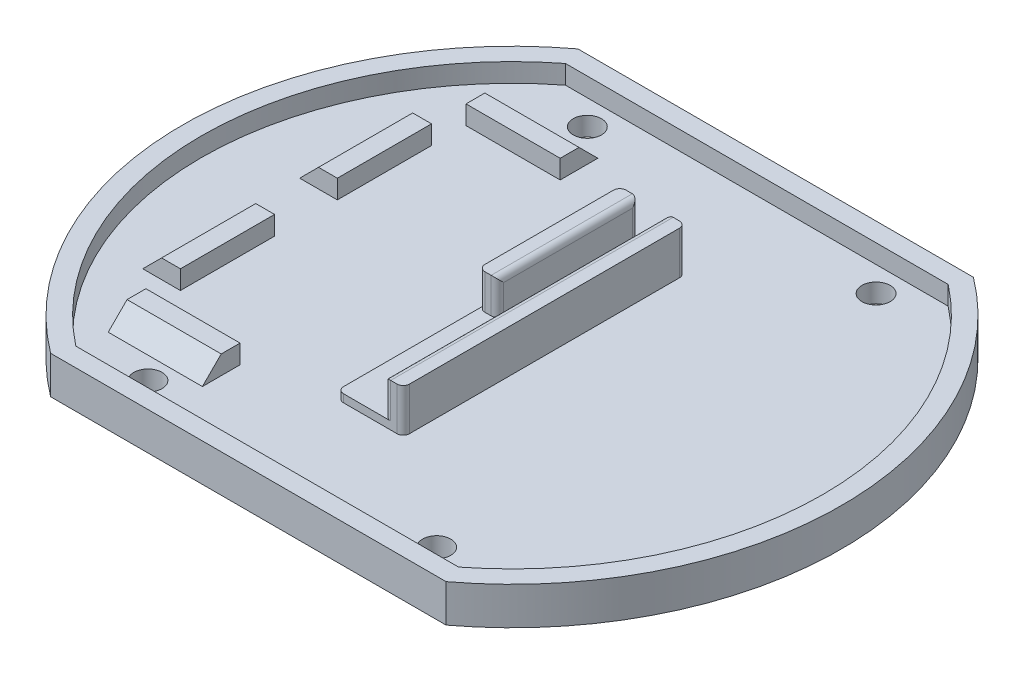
ISO-10303-21;
HEADER;
FILE_DESCRIPTION(('STEP AP214'),'2;1');
FILE_NAME('part.step','',(''),(''),'','','');
FILE_SCHEMA(('AUTOMOTIVE_DESIGN { 1 0 10303 214 1 1 1 1 }'));
ENDSEC;
DATA;
#1=APPLICATION_CONTEXT('core data for automotive mechanical design processes');
#2=APPLICATION_PROTOCOL_DEFINITION('international standard','automotive_design',2000,#1);
#3=PRODUCT_CONTEXT('',#1,'mechanical');
#4=PRODUCT('Part','Part','',(#3));
#5=PRODUCT_RELATED_PRODUCT_CATEGORY('part','',(#4));
#6=PRODUCT_DEFINITION_FORMATION('','',#4);
#7=PRODUCT_DEFINITION_CONTEXT('part definition',#1,'design');
#8=PRODUCT_DEFINITION('design','',#6,#7);
#9=PRODUCT_DEFINITION_SHAPE('','',#8);
#10=(LENGTH_UNIT() NAMED_UNIT(*) SI_UNIT(.MILLI.,.METRE.));
#11=(NAMED_UNIT(*) PLANE_ANGLE_UNIT() SI_UNIT($,.RADIAN.));
#12=(NAMED_UNIT(*) SI_UNIT($,.STERADIAN.) SOLID_ANGLE_UNIT());
#13=UNCERTAINTY_MEASURE_WITH_UNIT(LENGTH_MEASURE(1.E-05),#10,'distance_accuracy_value','');
#14=(GEOMETRIC_REPRESENTATION_CONTEXT(3) GLOBAL_UNCERTAINTY_ASSIGNED_CONTEXT((#13)) GLOBAL_UNIT_ASSIGNED_CONTEXT((#10,
#11,#12)) REPRESENTATION_CONTEXT('',''));
#15=CARTESIAN_POINT('',(0.,0.,0.));
#16=DIRECTION('',(0.,0.,1.));
#17=DIRECTION('',(1.,0.,0.));
#18=AXIS2_PLACEMENT_3D('',#15,#16,#17);
#19=CARTESIAN_POINT('',(0.,4.25,0.));
#20=DIRECTION('',(0.,1.,0.));
#21=DIRECTION('',(0.,0.,1.));
#22=AXIS2_PLACEMENT_3D('',#19,#20,#21);
#23=PLANE('',#22);
#24=DIRECTION('',(0.,0.,1.));
#25=VECTOR('',#24,1.);
#26=CARTESIAN_POINT('',(-5.32499999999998,4.25,-22.5));
#27=LINE('',#26,#25);
#28=CARTESIAN_POINT('',(-5.32499999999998,4.25,-1.));
#29=VERTEX_POINT('',#28);
#30=CARTESIAN_POINT('',(-5.32499999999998,4.25,21.5));
#31=VERTEX_POINT('',#30);
#32=EDGE_CURVE('E522',#29,#31,#27,.T.);
#33=ORIENTED_EDGE('',*,*,#32,.T.);
#34=CARTESIAN_POINT('',(-4.32499999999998,4.25,21.5));
#35=DIRECTION('',(0.,1.,0.));
#36=DIRECTION('',(0.,0.,1.));
#37=AXIS2_PLACEMENT_3D('',#34,#35,#36);
#38=CIRCLE('',#37,1.);
#39=CARTESIAN_POINT('',(-4.32499999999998,4.25,22.5));
#40=VERTEX_POINT('',#39);
#41=EDGE_CURVE('E667',#31,#40,#38,.T.);
#42=ORIENTED_EDGE('',*,*,#41,.T.);
#43=DIRECTION('',(1.,0.,0.));
#44=VECTOR('',#43,1.);
#45=CARTESIAN_POINT('',(5.17500000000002,4.25,22.5));
#46=LINE('',#45,#44);
#47=CARTESIAN_POINT('',(3.17500000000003,4.25,22.5));
#48=VERTEX_POINT('',#47);
#49=EDGE_CURVE('E526',#40,#48,#46,.T.);
#50=ORIENTED_EDGE('',*,*,#49,.T.);
#51=CARTESIAN_POINT('',(3.17500000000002,4.25,21.5));
#52=DIRECTION('',(0.,1.,0.));
#53=DIRECTION('',(0.,0.,1.));
#54=AXIS2_PLACEMENT_3D('',#51,#52,#53);
#55=CIRCLE('',#54,1.);
#56=CARTESIAN_POINT('',(2.17500000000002,4.25,21.5));
#57=VERTEX_POINT('',#56);
#58=EDGE_CURVE('E681',#48,#57,#55,.F.);
#59=ORIENTED_EDGE('',*,*,#58,.T.);
#60=DIRECTION('',(0.,0.,1.));
#61=VECTOR('',#60,1.);
#62=CARTESIAN_POINT('',(2.17500000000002,4.25,-22.5));
#63=LINE('',#62,#61);
#64=CARTESIAN_POINT('',(2.17500000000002,4.25,-21.5));
#65=VERTEX_POINT('',#64);
#66=EDGE_CURVE('E648',#65,#57,#63,.T.);
#67=ORIENTED_EDGE('',*,*,#66,.F.);
#68=CARTESIAN_POINT('',(3.17500000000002,4.25,-21.5));
#69=DIRECTION('',(0.,1.,0.));
#70=DIRECTION('',(0.,0.,1.));
#71=AXIS2_PLACEMENT_3D('',#68,#69,#70);
#72=CIRCLE('',#71,1.);
#73=CARTESIAN_POINT('',(3.17500000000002,4.25,-22.5));
#74=VERTEX_POINT('',#73);
#75=EDGE_CURVE('E675',#65,#74,#72,.F.);
#76=ORIENTED_EDGE('',*,*,#75,.T.);
#77=DIRECTION('',(-1.,0.,0.));
#78=VECTOR('',#77,1.);
#79=CARTESIAN_POINT('',(5.17500000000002,4.25,-22.5));
#80=LINE('',#79,#78);
#81=CARTESIAN_POINT('',(-3.32499999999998,4.25,-22.5));
#82=VERTEX_POINT('',#81);
#83=EDGE_CURVE('E527',#74,#82,#80,.T.);
#84=ORIENTED_EDGE('',*,*,#83,.T.);
#85=CARTESIAN_POINT('',(-3.32499999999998,4.25,-21.5));
#86=DIRECTION('',(0.,1.,0.));
#87=DIRECTION('',(0.,0.,1.));
#88=AXIS2_PLACEMENT_3D('',#85,#86,#87);
#89=CIRCLE('',#88,1.);
#90=CARTESIAN_POINT('',(-2.32499999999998,4.25,-21.5));
#91=VERTEX_POINT('',#90);
#92=EDGE_CURVE('E628',#82,#91,#89,.F.);
#93=ORIENTED_EDGE('',*,*,#92,.T.);
#94=DIRECTION('',(0.,0.,-1.));
#95=VECTOR('',#94,1.);
#96=CARTESIAN_POINT('',(-2.32499999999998,4.25,0.));
#97=LINE('',#96,#95);
#98=CARTESIAN_POINT('',(-2.32499999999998,4.25,-1.));
#99=VERTEX_POINT('',#98);
#100=EDGE_CURVE('E637',#99,#91,#97,.T.);
#101=ORIENTED_EDGE('',*,*,#100,.F.);
#102=CARTESIAN_POINT('',(-3.32499999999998,4.25,-1.));
#103=DIRECTION('',(0.,1.,0.));
#104=DIRECTION('',(0.,0.,1.));
#105=AXIS2_PLACEMENT_3D('',#102,#103,#104);
#106=CIRCLE('',#105,1.);
#107=CARTESIAN_POINT('',(-3.32499999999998,4.25,0.));
#108=VERTEX_POINT('',#107);
#109=EDGE_CURVE('E683',#99,#108,#106,.F.);
#110=ORIENTED_EDGE('',*,*,#109,.T.);
#111=DIRECTION('',(1.,0.,0.));
#112=VECTOR('',#111,1.);
#113=CARTESIAN_POINT('',(-5.32499999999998,4.25,0.));
#114=LINE('',#113,#112);
#115=CARTESIAN_POINT('',(-4.32499999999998,4.25,0.));
#116=VERTEX_POINT('',#115);
#117=EDGE_CURVE('E640',#116,#108,#114,.T.);
#118=ORIENTED_EDGE('',*,*,#117,.F.);
#119=CARTESIAN_POINT('',(-4.32499999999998,4.25,-1.));
#120=DIRECTION('',(0.,1.,0.));
#121=DIRECTION('',(0.,0.,1.));
#122=AXIS2_PLACEMENT_3D('',#119,#120,#121);
#123=CIRCLE('',#122,1.);
#124=EDGE_CURVE('E678',#116,#29,#123,.F.);
#125=ORIENTED_EDGE('',*,*,#124,.T.);
#126=EDGE_LOOP('',(#33,#42,#50,#59,#67,#76,#84,#93,#101,#110,#118,#125));
#127=FACE_BOUND('',#126,.T.);
#128=ADVANCED_FACE('F32',(#127),#23,.T.);
#129=CARTESIAN_POINT('',(0.,3.,0.));
#130=DIRECTION('',(0.,1.,0.));
#131=DIRECTION('',(0.,0.,1.));
#132=AXIS2_PLACEMENT_3D('',#129,#130,#131);
#133=PLANE('',#132);
#134=DIRECTION('',(1.,0.,0.));
#135=VECTOR('',#134,1.);
#136=CARTESIAN_POINT('',(-32.825,3.,20.));
#137=LINE('',#136,#135);
#138=CARTESIAN_POINT('',(-38.825,3.,20.));
#139=VERTEX_POINT('',#138);
#140=CARTESIAN_POINT('',(-32.825,3.,20.));
#141=VERTEX_POINT('',#140);
#142=EDGE_CURVE('E339',#139,#141,#137,.T.);
#143=ORIENTED_EDGE('',*,*,#142,.F.);
#144=DIRECTION('',(0.,0.,-1.));
#145=VECTOR('',#144,1.);
#146=CARTESIAN_POINT('',(-38.825,3.,0.));
#147=LINE('',#146,#145);
#148=CARTESIAN_POINT('',(-38.825,3.,5.));
#149=VERTEX_POINT('',#148);
#150=EDGE_CURVE('E504',#139,#149,#147,.T.);
#151=ORIENTED_EDGE('',*,*,#150,.T.);
#152=DIRECTION('',(-1.,0.,0.));
#153=VECTOR('',#152,1.);
#154=CARTESIAN_POINT('',(-32.825,3.,5.));
#155=LINE('',#154,#153);
#156=CARTESIAN_POINT('',(-32.825,3.,5.));
#157=VERTEX_POINT('',#156);
#158=EDGE_CURVE('E309',#157,#149,#155,.T.);
#159=ORIENTED_EDGE('',*,*,#158,.F.);
#160=DIRECTION('',(0.,0.,-1.));
#161=VECTOR('',#160,1.);
#162=CARTESIAN_POINT('',(-32.825,3.,20.));
#163=LINE('',#162,#161);
#164=EDGE_CURVE('E338',#141,#157,#163,.T.);
#165=ORIENTED_EDGE('',*,*,#164,.F.);
#166=EDGE_LOOP('',(#143,#151,#159,#165));
#167=FACE_BOUND('',#166,.T.);
#168=DIRECTION('',(0.,0.,-1.));
#169=VECTOR('',#168,1.);
#170=CARTESIAN_POINT('',(-17.825,3.,28.5));
#171=LINE('',#170,#169);
#172=CARTESIAN_POINT('',(-17.825,3.,31.5));
#173=VERTEX_POINT('',#172);
#174=CARTESIAN_POINT('',(-17.825,3.,25.5));
#175=VERTEX_POINT('',#174);
#176=EDGE_CURVE('E354',#173,#175,#171,.T.);
#177=ORIENTED_EDGE('',*,*,#176,.F.);
#178=DIRECTION('',(-1.,0.,0.));
#179=VECTOR('',#178,1.);
#180=CARTESIAN_POINT('',(0.,3.,31.5));
#181=LINE('',#180,#179);
#182=CARTESIAN_POINT('',(-32.825,3.,31.5));
#183=VERTEX_POINT('',#182);
#184=EDGE_CURVE('E498',#173,#183,#181,.T.);
#185=ORIENTED_EDGE('',*,*,#184,.T.);
#186=DIRECTION('',(0.,0.,1.));
#187=VECTOR('',#186,1.);
#188=CARTESIAN_POINT('',(-32.825,3.,28.5));
#189=LINE('',#188,#187);
#190=CARTESIAN_POINT('',(-32.825,3.,25.5));
#191=VERTEX_POINT('',#190);
#192=EDGE_CURVE('E365',#191,#183,#189,.T.);
#193=ORIENTED_EDGE('',*,*,#192,.F.);
#194=DIRECTION('',(-1.,0.,0.));
#195=VECTOR('',#194,1.);
#196=CARTESIAN_POINT('',(-32.825,3.,25.5));
#197=LINE('',#196,#195);
#198=EDGE_CURVE('E369',#175,#191,#197,.T.);
#199=ORIENTED_EDGE('',*,*,#198,.F.);
#200=EDGE_LOOP('',(#177,#185,#193,#199));
#201=FACE_BOUND('',#200,.T.);
#202=CARTESIAN_POINT('',(-23.,3.,35.));
#203=DIRECTION('',(0.,1.,0.));
#204=DIRECTION('',(0.,0.,1.));
#205=AXIS2_PLACEMENT_3D('',#202,#203,#204);
#206=CIRCLE('',#205,2.2479);
#207=CARTESIAN_POINT('',(-23.,3.,37.2479));
#208=VERTEX_POINT('',#207);
#209=EDGE_CURVE('E465',#208,#208,#206,.T.);
#210=ORIENTED_EDGE('',*,*,#209,.F.);
#211=EDGE_LOOP('',(#210));
#212=FACE_BOUND('',#211,.T.);
#213=CARTESIAN_POINT('',(23.,3.,35.));
#214=DIRECTION('',(0.,1.,0.));
#215=DIRECTION('',(0.,0.,1.));
#216=AXIS2_PLACEMENT_3D('',#213,#214,#215);
#217=CIRCLE('',#216,2.2479);
#218=CARTESIAN_POINT('',(23.,3.,37.2479));
#219=VERTEX_POINT('',#218);
#220=EDGE_CURVE('E461',#219,#219,#217,.T.);
#221=ORIENTED_EDGE('',*,*,#220,.F.);
#222=EDGE_LOOP('',(#221));
#223=FACE_BOUND('',#222,.T.);
#224=CARTESIAN_POINT('',(23.,3.,-35.));
#225=DIRECTION('',(0.,1.,0.));
#226=DIRECTION('',(0.,0.,1.));
#227=AXIS2_PLACEMENT_3D('',#224,#225,#226);
#228=CIRCLE('',#227,2.2479);
#229=CARTESIAN_POINT('',(23.,3.,-32.7521));
#230=VERTEX_POINT('',#229);
#231=EDGE_CURVE('E457',#230,#230,#228,.T.);
#232=ORIENTED_EDGE('',*,*,#231,.F.);
#233=EDGE_LOOP('',(#232));
#234=FACE_BOUND('',#233,.T.);
#235=CARTESIAN_POINT('',(-23.,3.,-35.));
#236=DIRECTION('',(0.,1.,0.));
#237=DIRECTION('',(0.,0.,1.));
#238=AXIS2_PLACEMENT_3D('',#235,#236,#237);
#239=CIRCLE('',#238,2.2479);
#240=CARTESIAN_POINT('',(-23.,3.,-32.7521));
#241=VERTEX_POINT('',#240);
#242=EDGE_CURVE('E453',#241,#241,#239,.T.);
#243=ORIENTED_EDGE('',*,*,#242,.F.);
#244=EDGE_LOOP('',(#243));
#245=FACE_BOUND('',#244,.T.);
#246=CARTESIAN_POINT('',(0.,3.,0.));
#247=DIRECTION('',(0.,1.,0.));
#248=DIRECTION('',(0.,0.,1.));
#249=AXIS2_PLACEMENT_3D('',#246,#247,#248);
#250=CIRCLE('',#249,49.5);
#251=CARTESIAN_POINT('',(30.4836021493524,3.,39.));
#252=VERTEX_POINT('',#251);
#253=CARTESIAN_POINT('',(30.4836021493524,3.,-39.));
#254=VERTEX_POINT('',#253);
#255=EDGE_CURVE('E402',#252,#254,#250,.T.);
#256=ORIENTED_EDGE('',*,*,#255,.T.);
#257=DIRECTION('',(-1.,0.,0.));
#258=VECTOR('',#257,1.);
#259=CARTESIAN_POINT('',(30.4836021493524,3.,-39.));
#260=LINE('',#259,#258);
#261=CARTESIAN_POINT('',(-30.4836021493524,3.,-39.));
#262=VERTEX_POINT('',#261);
#263=EDGE_CURVE('E425',#254,#262,#260,.T.);
#264=ORIENTED_EDGE('',*,*,#263,.T.);
#265=CARTESIAN_POINT('',(0.,3.,0.));
#266=DIRECTION('',(0.,1.,0.));
#267=DIRECTION('',(0.,0.,1.));
#268=AXIS2_PLACEMENT_3D('',#265,#266,#267);
#269=CIRCLE('',#268,49.5);
#270=CARTESIAN_POINT('',(-30.4836021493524,3.,39.));
#271=VERTEX_POINT('',#270);
#272=EDGE_CURVE('E427',#262,#271,#269,.T.);
#273=ORIENTED_EDGE('',*,*,#272,.T.);
#274=DIRECTION('',(1.,0.,0.));
#275=VECTOR('',#274,1.);
#276=CARTESIAN_POINT('',(-30.4836021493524,3.,39.));
#277=LINE('',#276,#275);
#278=EDGE_CURVE('E416',#271,#252,#277,.T.);
#279=ORIENTED_EDGE('',*,*,#278,.T.);
#280=EDGE_LOOP('',(#256,#264,#273,#279));
#281=FACE_BOUND('',#280,.T.);
#282=DIRECTION('',(0.,0.,1.));
#283=VECTOR('',#282,1.);
#284=CARTESIAN_POINT('',(-32.825,3.,-28.5));
#285=LINE('',#284,#283);
#286=CARTESIAN_POINT('',(-32.825,3.,-31.5));
#287=VERTEX_POINT('',#286);
#288=CARTESIAN_POINT('',(-32.825,3.,-25.5));
#289=VERTEX_POINT('',#288);
#290=EDGE_CURVE('E377',#287,#289,#285,.T.);
#291=ORIENTED_EDGE('',*,*,#290,.F.);
#292=DIRECTION('',(1.,0.,0.));
#293=VECTOR('',#292,1.);
#294=CARTESIAN_POINT('',(0.,3.,-31.5));
#295=LINE('',#294,#293);
#296=CARTESIAN_POINT('',(-17.825,3.,-31.5));
#297=VERTEX_POINT('',#296);
#298=EDGE_CURVE('E487',#287,#297,#295,.T.);
#299=ORIENTED_EDGE('',*,*,#298,.T.);
#300=DIRECTION('',(0.,0.,-1.));
#301=VECTOR('',#300,1.);
#302=CARTESIAN_POINT('',(-17.825,3.,-28.5));
#303=LINE('',#302,#301);
#304=CARTESIAN_POINT('',(-17.825,3.,-25.5));
#305=VERTEX_POINT('',#304);
#306=EDGE_CURVE('E389',#305,#297,#303,.T.);
#307=ORIENTED_EDGE('',*,*,#306,.F.);
#308=DIRECTION('',(1.,0.,0.));
#309=VECTOR('',#308,1.);
#310=CARTESIAN_POINT('',(-32.825,3.,-25.5));
#311=LINE('',#310,#309);
#312=EDGE_CURVE('E393',#289,#305,#311,.T.);
#313=ORIENTED_EDGE('',*,*,#312,.F.);
#314=EDGE_LOOP('',(#291,#299,#307,#313));
#315=FACE_BOUND('',#314,.T.);
#316=DIRECTION('',(1.,0.,0.));
#317=VECTOR('',#316,1.);
#318=CARTESIAN_POINT('',(-32.825,3.,-5.));
#319=LINE('',#318,#317);
#320=CARTESIAN_POINT('',(-38.825,3.,-5.));
#321=VERTEX_POINT('',#320);
#322=CARTESIAN_POINT('',(-32.825,3.,-5.));
#323=VERTEX_POINT('',#322);
#324=EDGE_CURVE('E341',#321,#323,#319,.T.);
#325=ORIENTED_EDGE('',*,*,#324,.F.);
#326=DIRECTION('',(0.,0.,-1.));
#327=VECTOR('',#326,1.);
#328=CARTESIAN_POINT('',(-38.825,3.,0.));
#329=LINE('',#328,#327);
#330=CARTESIAN_POINT('',(-38.825,3.,-20.));
#331=VERTEX_POINT('',#330);
#332=EDGE_CURVE('E501',#321,#331,#329,.T.);
#333=ORIENTED_EDGE('',*,*,#332,.T.);
#334=DIRECTION('',(-1.,0.,0.));
#335=VECTOR('',#334,1.);
#336=CARTESIAN_POINT('',(-32.825,3.,-20.));
#337=LINE('',#336,#335);
#338=CARTESIAN_POINT('',(-32.825,3.,-20.));
#339=VERTEX_POINT('',#338);
#340=EDGE_CURVE('E345',#339,#331,#337,.T.);
#341=ORIENTED_EDGE('',*,*,#340,.F.);
#342=DIRECTION('',(0.,0.,-1.));
#343=VECTOR('',#342,1.);
#344=CARTESIAN_POINT('',(-32.825,3.,-20.));
#345=LINE('',#344,#343);
#346=EDGE_CURVE('E348',#323,#339,#345,.T.);
#347=ORIENTED_EDGE('',*,*,#346,.F.);
#348=EDGE_LOOP('',(#325,#333,#341,#347));
#349=FACE_BOUND('',#348,.T.);
#350=DIRECTION('',(0.,0.,1.));
#351=VECTOR('',#350,1.);
#352=CARTESIAN_POINT('',(-5.32499999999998,3.,-22.5));
#353=LINE('',#352,#351);
#354=CARTESIAN_POINT('',(-5.32499999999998,3.,-21.5));
#355=VERTEX_POINT('',#354);
#356=CARTESIAN_POINT('',(-5.32499999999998,3.,21.5));
#357=VERTEX_POINT('',#356);
#358=EDGE_CURVE('E539',#355,#357,#353,.T.);
#359=ORIENTED_EDGE('',*,*,#358,.F.);
#360=CARTESIAN_POINT('',(-4.32499999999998,3.,-21.5));
#361=DIRECTION('',(0.,1.,0.));
#362=DIRECTION('',(0.,0.,1.));
#363=AXIS2_PLACEMENT_3D('',#360,#361,#362);
#364=CIRCLE('',#363,1.);
#365=CARTESIAN_POINT('',(-4.32499999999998,3.,-22.5));
#366=VERTEX_POINT('',#365);
#367=EDGE_CURVE('E687',#355,#366,#364,.F.);
#368=ORIENTED_EDGE('',*,*,#367,.T.);
#369=DIRECTION('',(-1.,0.,0.));
#370=VECTOR('',#369,1.);
#371=CARTESIAN_POINT('',(5.17500000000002,3.,-22.5));
#372=LINE('',#371,#370);
#373=CARTESIAN_POINT('',(4.17500000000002,3.,-22.5));
#374=VERTEX_POINT('',#373);
#375=EDGE_CURVE('E536',#374,#366,#372,.T.);
#376=ORIENTED_EDGE('',*,*,#375,.F.);
#377=CARTESIAN_POINT('',(4.17500000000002,3.,-21.5));
#378=DIRECTION('',(0.,1.,0.));
#379=DIRECTION('',(0.,0.,1.));
#380=AXIS2_PLACEMENT_3D('',#377,#378,#379);
#381=CIRCLE('',#380,1.);
#382=CARTESIAN_POINT('',(5.17500000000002,3.,-21.5));
#383=VERTEX_POINT('',#382);
#384=EDGE_CURVE('E685',#374,#383,#381,.F.);
#385=ORIENTED_EDGE('',*,*,#384,.T.);
#386=DIRECTION('',(0.,0.,-1.));
#387=VECTOR('',#386,1.);
#388=CARTESIAN_POINT('',(5.17500000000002,3.,-22.5));
#389=LINE('',#388,#387);
#390=CARTESIAN_POINT('',(5.17500000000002,3.,21.5));
#391=VERTEX_POINT('',#390);
#392=EDGE_CURVE('E546',#391,#383,#389,.T.);
#393=ORIENTED_EDGE('',*,*,#392,.F.);
#394=CARTESIAN_POINT('',(4.17500000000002,3.,21.5));
#395=DIRECTION('',(0.,1.,0.));
#396=DIRECTION('',(0.,0.,1.));
#397=AXIS2_PLACEMENT_3D('',#394,#395,#396);
#398=CIRCLE('',#397,1.);
#399=CARTESIAN_POINT('',(4.17500000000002,3.,22.5));
#400=VERTEX_POINT('',#399);
#401=EDGE_CURVE('E41',#391,#400,#398,.F.);
#402=ORIENTED_EDGE('',*,*,#401,.T.);
#403=DIRECTION('',(1.,0.,0.));
#404=VECTOR('',#403,1.);
#405=CARTESIAN_POINT('',(5.17500000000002,3.,22.5));
#406=LINE('',#405,#404);
#407=CARTESIAN_POINT('',(-4.32499999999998,3.,22.5));
#408=VERTEX_POINT('',#407);
#409=EDGE_CURVE('E543',#408,#400,#406,.T.);
#410=ORIENTED_EDGE('',*,*,#409,.F.);
#411=CARTESIAN_POINT('',(-4.32499999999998,3.,21.5));
#412=DIRECTION('',(0.,1.,0.));
#413=DIRECTION('',(0.,0.,1.));
#414=AXIS2_PLACEMENT_3D('',#411,#412,#413);
#415=CIRCLE('',#414,1.);
#416=EDGE_CURVE('E11',#408,#357,#415,.F.);
#417=ORIENTED_EDGE('',*,*,#416,.T.);
#418=EDGE_LOOP('',(#359,#368,#376,#385,#393,#402,#410,#417));
#419=FACE_BOUND('',#418,.T.);
#420=ADVANCED_FACE('F556',(#167,#201,#212,#223,#234,#245,#281,#315,#349,#419),#133,.T.);
#421=CARTESIAN_POINT('',(0.,3.,0.));
#422=DIRECTION('',(0.,-1.,0.));
#423=DIRECTION('',(0.,0.,-1.));
#424=AXIS2_PLACEMENT_3D('',#421,#422,#423);
#425=CYLINDRICAL_SURFACE('',#424,52.5);
#426=DIRECTION('',(0.,1.,0.));
#427=VECTOR('',#426,1.);
#428=CARTESIAN_POINT('',(31.5,0.,-42.));
#429=LINE('',#428,#427);
#430=CARTESIAN_POINT('',(31.5,0.,-42.));
#431=VERTEX_POINT('',#430);
#432=CARTESIAN_POINT('',(31.5,6.,-42.));
#433=VERTEX_POINT('',#432);
#434=EDGE_CURVE('E480',#431,#433,#429,.T.);
#435=ORIENTED_EDGE('',*,*,#434,.T.);
#436=CARTESIAN_POINT('',(0.,6.,0.));
#437=DIRECTION('',(0.,1.,0.));
#438=DIRECTION('',(0.,0.,1.));
#439=AXIS2_PLACEMENT_3D('',#436,#437,#438);
#440=CIRCLE('',#439,52.5);
#441=CARTESIAN_POINT('',(31.5,6.,42.));
#442=VERTEX_POINT('',#441);
#443=EDGE_CURVE('E447',#442,#433,#440,.T.);
#444=ORIENTED_EDGE('',*,*,#443,.F.);
#445=DIRECTION('',(0.,1.,0.));
#446=VECTOR('',#445,1.);
#447=CARTESIAN_POINT('',(31.5,0.,42.));
#448=LINE('',#447,#446);
#449=CARTESIAN_POINT('',(31.5,0.,42.));
#450=VERTEX_POINT('',#449);
#451=EDGE_CURVE('E473',#450,#442,#448,.T.);
#452=ORIENTED_EDGE('',*,*,#451,.F.);
#453=CARTESIAN_POINT('',(0.,0.,0.));
#454=DIRECTION('',(0.,1.,0.));
#455=DIRECTION('',(0.,0.,1.));
#456=AXIS2_PLACEMENT_3D('',#453,#454,#455);
#457=CIRCLE('',#456,52.5);
#458=EDGE_CURVE('E482',#450,#431,#457,.T.);
#459=ORIENTED_EDGE('',*,*,#458,.T.);
#460=EDGE_LOOP('',(#435,#444,#452,#459));
#461=FACE_BOUND('',#460,.T.);
#462=ADVANCED_FACE('F575',(#461),#425,.T.);
#463=CARTESIAN_POINT('',(0.,0.,0.));
#464=DIRECTION('',(0.,1.,0.));
#465=DIRECTION('',(0.,0.,1.));
#466=AXIS2_PLACEMENT_3D('',#463,#464,#465);
#467=PLANE('',#466);
#468=CARTESIAN_POINT('',(-23.,0.,-35.));
#469=DIRECTION('',(0.,1.,0.));
#470=DIRECTION('',(0.,0.,1.));
#471=AXIS2_PLACEMENT_3D('',#468,#469,#470);
#472=CIRCLE('',#471,2.2479);
#473=CARTESIAN_POINT('',(-23.,0.,-32.7521));
#474=VERTEX_POINT('',#473);
#475=EDGE_CURVE('E456',#474,#474,#472,.T.);
#476=ORIENTED_EDGE('',*,*,#475,.T.);
#477=EDGE_LOOP('',(#476));
#478=FACE_BOUND('',#477,.T.);
#479=CARTESIAN_POINT('',(23.,0.,-35.));
#480=DIRECTION('',(0.,1.,0.));
#481=DIRECTION('',(0.,0.,1.));
#482=AXIS2_PLACEMENT_3D('',#479,#480,#481);
#483=CIRCLE('',#482,2.2479);
#484=CARTESIAN_POINT('',(23.,0.,-32.7521));
#485=VERTEX_POINT('',#484);
#486=EDGE_CURVE('E460',#485,#485,#483,.T.);
#487=ORIENTED_EDGE('',*,*,#486,.T.);
#488=EDGE_LOOP('',(#487));
#489=FACE_BOUND('',#488,.T.);
#490=CARTESIAN_POINT('',(23.,0.,35.));
#491=DIRECTION('',(0.,1.,0.));
#492=DIRECTION('',(0.,0.,1.));
#493=AXIS2_PLACEMENT_3D('',#490,#491,#492);
#494=CIRCLE('',#493,2.2479);
#495=CARTESIAN_POINT('',(23.,0.,37.2479));
#496=VERTEX_POINT('',#495);
#497=EDGE_CURVE('E464',#496,#496,#494,.T.);
#498=ORIENTED_EDGE('',*,*,#497,.T.);
#499=EDGE_LOOP('',(#498));
#500=FACE_BOUND('',#499,.T.);
#501=CARTESIAN_POINT('',(-23.,0.,35.));
#502=DIRECTION('',(0.,1.,0.));
#503=DIRECTION('',(0.,0.,1.));
#504=AXIS2_PLACEMENT_3D('',#501,#502,#503);
#505=CIRCLE('',#504,2.2479);
#506=CARTESIAN_POINT('',(-23.,0.,37.2479));
#507=VERTEX_POINT('',#506);
#508=EDGE_CURVE('E468',#507,#507,#505,.T.);
#509=ORIENTED_EDGE('',*,*,#508,.T.);
#510=EDGE_LOOP('',(#509));
#511=FACE_BOUND('',#510,.T.);
#512=ORIENTED_EDGE('',*,*,#458,.F.);
#513=DIRECTION('',(-1.,0.,0.));
#514=VECTOR('',#513,1.);
#515=CARTESIAN_POINT('',(-31.5,0.,42.));
#516=LINE('',#515,#514);
#517=CARTESIAN_POINT('',(-31.5,0.,42.));
#518=VERTEX_POINT('',#517);
#519=EDGE_CURVE('E469',#450,#518,#516,.T.);
#520=ORIENTED_EDGE('',*,*,#519,.T.);
#521=CARTESIAN_POINT('',(-31.5,0.,-42.));
#522=VERTEX_POINT('',#521);
#523=EDGE_CURVE('E484',#522,#518,#457,.T.);
#524=ORIENTED_EDGE('',*,*,#523,.F.);
#525=DIRECTION('',(1.,0.,0.));
#526=VECTOR('',#525,1.);
#527=CARTESIAN_POINT('',(-31.5,0.,-42.));
#528=LINE('',#527,#526);
#529=EDGE_CURVE('E475',#522,#431,#528,.T.);
#530=ORIENTED_EDGE('',*,*,#529,.T.);
#531=EDGE_LOOP('',(#512,#520,#524,#530));
#532=FACE_BOUND('',#531,.T.);
#533=ADVANCED_FACE('F822',(#478,#489,#500,#511,#532),#467,.F.);
#534=ORIENTED_EDGE('',*,*,#523,.T.);
#535=DIRECTION('',(0.,1.,0.));
#536=VECTOR('',#535,1.);
#537=CARTESIAN_POINT('',(-31.5,0.,42.));
#538=LINE('',#537,#536);
#539=CARTESIAN_POINT('',(-31.5,6.,42.));
#540=VERTEX_POINT('',#539);
#541=EDGE_CURVE('E472',#518,#540,#538,.T.);
#542=ORIENTED_EDGE('',*,*,#541,.T.);
#543=CARTESIAN_POINT('',(0.,6.,0.));
#544=DIRECTION('',(0.,1.,0.));
#545=DIRECTION('',(0.,0.,1.));
#546=AXIS2_PLACEMENT_3D('',#543,#544,#545);
#547=CIRCLE('',#546,52.5);
#548=CARTESIAN_POINT('',(-31.5,6.,-42.));
#549=VERTEX_POINT('',#548);
#550=EDGE_CURVE('E441',#549,#540,#547,.T.);
#551=ORIENTED_EDGE('',*,*,#550,.F.);
#552=DIRECTION('',(0.,1.,0.));
#553=VECTOR('',#552,1.);
#554=CARTESIAN_POINT('',(-31.5,0.,-42.));
#555=LINE('',#554,#553);
#556=EDGE_CURVE('E479',#522,#549,#555,.T.);
#557=ORIENTED_EDGE('',*,*,#556,.F.);
#558=EDGE_LOOP('',(#534,#542,#551,#557));
#559=FACE_BOUND('',#558,.T.);
#560=ADVANCED_FACE('F818',(#559),#425,.T.);
#561=CARTESIAN_POINT('',(-31.5,0.,-42.));
#562=DIRECTION('',(0.,0.,1.));
#563=DIRECTION('',(1.,0.,0.));
#564=AXIS2_PLACEMENT_3D('',#561,#562,#563);
#565=PLANE('',#564);
#566=ORIENTED_EDGE('',*,*,#556,.T.);
#567=DIRECTION('',(-1.,0.,0.));
#568=VECTOR('',#567,1.);
#569=CARTESIAN_POINT('',(31.5,6.,-42.));
#570=LINE('',#569,#568);
#571=EDGE_CURVE('E450',#433,#549,#570,.T.);
#572=ORIENTED_EDGE('',*,*,#571,.F.);
#573=ORIENTED_EDGE('',*,*,#434,.F.);
#574=ORIENTED_EDGE('',*,*,#529,.F.);
#575=EDGE_LOOP('',(#566,#572,#573,#574));
#576=FACE_BOUND('',#575,.T.);
#577=ADVANCED_FACE('F821',(#576),#565,.F.);
#578=CARTESIAN_POINT('',(-31.5,0.,42.));
#579=DIRECTION('',(0.,0.,-1.));
#580=DIRECTION('',(-1.,0.,0.));
#581=AXIS2_PLACEMENT_3D('',#578,#579,#580);
#582=PLANE('',#581);
#583=ORIENTED_EDGE('',*,*,#451,.T.);
#584=DIRECTION('',(1.,0.,0.));
#585=VECTOR('',#584,1.);
#586=CARTESIAN_POINT('',(-31.5,6.,42.));
#587=LINE('',#586,#585);
#588=EDGE_CURVE('E444',#540,#442,#587,.T.);
#589=ORIENTED_EDGE('',*,*,#588,.F.);
#590=ORIENTED_EDGE('',*,*,#541,.F.);
#591=ORIENTED_EDGE('',*,*,#519,.F.);
#592=EDGE_LOOP('',(#583,#589,#590,#591));
#593=FACE_BOUND('',#592,.T.);
#594=ADVANCED_FACE('F829',(#593),#582,.F.);
#595=CARTESIAN_POINT('',(-23.,3.,35.));
#596=DIRECTION('',(0.,1.,0.));
#597=DIRECTION('',(0.,0.,1.));
#598=AXIS2_PLACEMENT_3D('',#595,#596,#597);
#599=CYLINDRICAL_SURFACE('',#598,2.2479);
#600=ORIENTED_EDGE('',*,*,#209,.T.);
#601=EDGE_LOOP('',(#600));
#602=FACE_BOUND('',#601,.T.);
#603=ORIENTED_EDGE('',*,*,#508,.F.);
#604=EDGE_LOOP('',(#603));
#605=FACE_BOUND('',#604,.T.);
#606=ADVANCED_FACE('F833',(#602,#605),#599,.F.);
#607=CARTESIAN_POINT('',(23.,3.,35.));
#608=DIRECTION('',(0.,1.,0.));
#609=DIRECTION('',(0.,0.,1.));
#610=AXIS2_PLACEMENT_3D('',#607,#608,#609);
#611=CYLINDRICAL_SURFACE('',#610,2.2479);
#612=ORIENTED_EDGE('',*,*,#220,.T.);
#613=EDGE_LOOP('',(#612));
#614=FACE_BOUND('',#613,.T.);
#615=ORIENTED_EDGE('',*,*,#497,.F.);
#616=EDGE_LOOP('',(#615));
#617=FACE_BOUND('',#616,.T.);
#618=ADVANCED_FACE('F837',(#614,#617),#611,.F.);
#619=CARTESIAN_POINT('',(23.,3.,-35.));
#620=DIRECTION('',(0.,1.,0.));
#621=DIRECTION('',(0.,0.,1.));
#622=AXIS2_PLACEMENT_3D('',#619,#620,#621);
#623=CYLINDRICAL_SURFACE('',#622,2.2479);
#624=ORIENTED_EDGE('',*,*,#231,.T.);
#625=EDGE_LOOP('',(#624));
#626=FACE_BOUND('',#625,.T.);
#627=ORIENTED_EDGE('',*,*,#486,.F.);
#628=EDGE_LOOP('',(#627));
#629=FACE_BOUND('',#628,.T.);
#630=ADVANCED_FACE('F841',(#626,#629),#623,.F.);
#631=CARTESIAN_POINT('',(-23.,3.,-35.));
#632=DIRECTION('',(0.,1.,0.));
#633=DIRECTION('',(0.,0.,1.));
#634=AXIS2_PLACEMENT_3D('',#631,#632,#633);
#635=CYLINDRICAL_SURFACE('',#634,2.2479);
#636=ORIENTED_EDGE('',*,*,#242,.T.);
#637=EDGE_LOOP('',(#636));
#638=FACE_BOUND('',#637,.T.);
#639=ORIENTED_EDGE('',*,*,#475,.F.);
#640=EDGE_LOOP('',(#639));
#641=FACE_BOUND('',#640,.T.);
#642=ADVANCED_FACE('F845',(#638,#641),#635,.F.);
#643=CARTESIAN_POINT('',(0.,6.,0.));
#644=DIRECTION('',(0.,1.,0.));
#645=DIRECTION('',(0.,0.,1.));
#646=AXIS2_PLACEMENT_3D('',#643,#644,#645);
#647=PLANE('',#646);
#648=ORIENTED_EDGE('',*,*,#550,.T.);
#649=ORIENTED_EDGE('',*,*,#588,.T.);
#650=ORIENTED_EDGE('',*,*,#443,.T.);
#651=ORIENTED_EDGE('',*,*,#571,.T.);
#652=EDGE_LOOP('',(#648,#649,#650,#651));
#653=FACE_BOUND('',#652,.T.);
#654=DIRECTION('',(-1.,0.,0.));
#655=VECTOR('',#654,1.);
#656=CARTESIAN_POINT('',(30.4836021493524,6.,-39.));
#657=LINE('',#656,#655);
#658=CARTESIAN_POINT('',(30.4836021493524,6.,-39.));
#659=VERTEX_POINT('',#658);
#660=CARTESIAN_POINT('',(-30.4836021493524,6.,-39.));
#661=VERTEX_POINT('',#660);
#662=EDGE_CURVE('E415',#659,#661,#657,.T.);
#663=ORIENTED_EDGE('',*,*,#662,.F.);
#664=CARTESIAN_POINT('',(0.,6.,0.));
#665=DIRECTION('',(0.,1.,0.));
#666=DIRECTION('',(0.,0.,1.));
#667=AXIS2_PLACEMENT_3D('',#664,#665,#666);
#668=CIRCLE('',#667,49.5);
#669=CARTESIAN_POINT('',(30.4836021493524,6.,39.));
#670=VERTEX_POINT('',#669);
#671=EDGE_CURVE('E413',#670,#659,#668,.T.);
#672=ORIENTED_EDGE('',*,*,#671,.F.);
#673=DIRECTION('',(1.,0.,0.));
#674=VECTOR('',#673,1.);
#675=CARTESIAN_POINT('',(-30.4836021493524,6.,39.));
#676=LINE('',#675,#674);
#677=CARTESIAN_POINT('',(-30.4836021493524,6.,39.));
#678=VERTEX_POINT('',#677);
#679=EDGE_CURVE('E421',#678,#670,#676,.T.);
#680=ORIENTED_EDGE('',*,*,#679,.F.);
#681=CARTESIAN_POINT('',(0.,6.,0.));
#682=DIRECTION('',(0.,1.,0.));
#683=DIRECTION('',(0.,0.,1.));
#684=AXIS2_PLACEMENT_3D('',#681,#682,#683);
#685=CIRCLE('',#684,49.5);
#686=EDGE_CURVE('E418',#661,#678,#685,.T.);
#687=ORIENTED_EDGE('',*,*,#686,.F.);
#688=EDGE_LOOP('',(#663,#672,#680,#687));
#689=FACE_BOUND('',#688,.T.);
#690=ADVANCED_FACE('F849',(#653,#689),#647,.T.);
#691=CARTESIAN_POINT('',(0.,6.,0.));
#692=DIRECTION('',(0.,-1.,0.));
#693=DIRECTION('',(0.,0.,-1.));
#694=AXIS2_PLACEMENT_3D('',#691,#692,#693);
#695=CYLINDRICAL_SURFACE('',#694,49.5);
#696=ORIENTED_EDGE('',*,*,#255,.F.);
#697=DIRECTION('',(0.,-1.,0.));
#698=VECTOR('',#697,1.);
#699=CARTESIAN_POINT('',(30.4836021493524,6.,39.));
#700=LINE('',#699,#698);
#701=EDGE_CURVE('E423',#670,#252,#700,.T.);
#702=ORIENTED_EDGE('',*,*,#701,.F.);
#703=ORIENTED_EDGE('',*,*,#671,.T.);
#704=DIRECTION('',(0.,-1.,0.));
#705=VECTOR('',#704,1.);
#706=CARTESIAN_POINT('',(30.4836021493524,6.,-39.));
#707=LINE('',#706,#705);
#708=EDGE_CURVE('E438',#659,#254,#707,.T.);
#709=ORIENTED_EDGE('',*,*,#708,.T.);
#710=EDGE_LOOP('',(#696,#702,#703,#709));
#711=FACE_BOUND('',#710,.T.);
#712=ADVANCED_FACE('F853',(#711),#695,.F.);
#713=CARTESIAN_POINT('',(30.4836021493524,6.,-39.));
#714=DIRECTION('',(0.,0.,1.));
#715=DIRECTION('',(1.,0.,0.));
#716=AXIS2_PLACEMENT_3D('',#713,#714,#715);
#717=PLANE('',#716);
#718=ORIENTED_EDGE('',*,*,#263,.F.);
#719=ORIENTED_EDGE('',*,*,#708,.F.);
#720=ORIENTED_EDGE('',*,*,#662,.T.);
#721=DIRECTION('',(0.,-1.,0.));
#722=VECTOR('',#721,1.);
#723=CARTESIAN_POINT('',(-30.4836021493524,6.,-39.));
#724=LINE('',#723,#722);
#725=EDGE_CURVE('E435',#661,#262,#724,.T.);
#726=ORIENTED_EDGE('',*,*,#725,.T.);
#727=EDGE_LOOP('',(#718,#719,#720,#726));
#728=FACE_BOUND('',#727,.T.);
#729=ADVANCED_FACE('F857',(#728),#717,.T.);
#730=CARTESIAN_POINT('',(0.,6.,0.));
#731=DIRECTION('',(0.,-1.,0.));
#732=DIRECTION('',(0.,0.,-1.));
#733=AXIS2_PLACEMENT_3D('',#730,#731,#732);
#734=CYLINDRICAL_SURFACE('',#733,49.5);
#735=ORIENTED_EDGE('',*,*,#272,.F.);
#736=ORIENTED_EDGE('',*,*,#725,.F.);
#737=ORIENTED_EDGE('',*,*,#686,.T.);
#738=DIRECTION('',(0.,-1.,0.));
#739=VECTOR('',#738,1.);
#740=CARTESIAN_POINT('',(-30.4836021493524,6.,39.));
#741=LINE('',#740,#739);
#742=EDGE_CURVE('E432',#678,#271,#741,.T.);
#743=ORIENTED_EDGE('',*,*,#742,.T.);
#744=EDGE_LOOP('',(#735,#736,#737,#743));
#745=FACE_BOUND('',#744,.T.);
#746=ADVANCED_FACE('F861',(#745),#734,.F.);
#747=CARTESIAN_POINT('',(-30.4836021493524,6.,39.));
#748=DIRECTION('',(0.,0.,-1.));
#749=DIRECTION('',(-1.,0.,0.));
#750=AXIS2_PLACEMENT_3D('',#747,#748,#749);
#751=PLANE('',#750);
#752=ORIENTED_EDGE('',*,*,#278,.F.);
#753=ORIENTED_EDGE('',*,*,#742,.F.);
#754=ORIENTED_EDGE('',*,*,#679,.T.);
#755=ORIENTED_EDGE('',*,*,#701,.T.);
#756=EDGE_LOOP('',(#752,#753,#754,#755));
#757=FACE_BOUND('',#756,.T.);
#758=ADVANCED_FACE('F865',(#757),#751,.T.);
#759=CARTESIAN_POINT('',(-32.825,21.2970585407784,-28.5));
#760=DIRECTION('',(1.,0.,0.));
#761=DIRECTION('',(0.,0.,-1.));
#762=AXIS2_PLACEMENT_3D('',#759,#760,#761);
#763=PLANE('',#762);
#764=DIRECTION('',(0.,0.,1.));
#765=VECTOR('',#764,1.);
#766=CARTESIAN_POINT('',(-32.825,6.,-28.5));
#767=LINE('',#766,#765);
#768=CARTESIAN_POINT('',(-32.825,6.,-28.5));
#769=VERTEX_POINT('',#768);
#770=CARTESIAN_POINT('',(-32.825,6.,-25.5));
#771=VERTEX_POINT('',#770);
#772=EDGE_CURVE('E406',#769,#771,#767,.T.);
#773=ORIENTED_EDGE('',*,*,#772,.F.);
#774=DIRECTION('',(0.,-0.707106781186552,-0.707106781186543));
#775=VECTOR('',#774,1.);
#776=CARTESIAN_POINT('',(-32.825,13.6485292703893,-20.8514707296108));
#777=LINE('',#776,#775);
#778=EDGE_CURVE('E516',#769,#287,#777,.T.);
#779=ORIENTED_EDGE('',*,*,#778,.T.);
#780=ORIENTED_EDGE('',*,*,#290,.T.);
#781=DIRECTION('',(0.,-1.,0.));
#782=VECTOR('',#781,1.);
#783=CARTESIAN_POINT('',(-32.825,21.2970585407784,-25.5));
#784=LINE('',#783,#782);
#785=EDGE_CURVE('E396',#771,#289,#784,.T.);
#786=ORIENTED_EDGE('',*,*,#785,.F.);
#787=EDGE_LOOP('',(#773,#779,#780,#786));
#788=FACE_BOUND('',#787,.T.);
#789=ADVANCED_FACE('F869',(#788),#763,.F.);
#790=CARTESIAN_POINT('',(-32.825,21.2970585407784,-25.5));
#791=DIRECTION('',(0.,0.,-1.));
#792=DIRECTION('',(-1.,0.,0.));
#793=AXIS2_PLACEMENT_3D('',#790,#791,#792);
#794=PLANE('',#793);
#795=DIRECTION('',(1.,0.,0.));
#796=VECTOR('',#795,1.);
#797=CARTESIAN_POINT('',(-32.825,6.,-25.5));
#798=LINE('',#797,#796);
#799=CARTESIAN_POINT('',(-17.825,6.,-25.5));
#800=VERTEX_POINT('',#799);
#801=EDGE_CURVE('E403',#771,#800,#798,.T.);
#802=ORIENTED_EDGE('',*,*,#801,.F.);
#803=ORIENTED_EDGE('',*,*,#785,.T.);
#804=ORIENTED_EDGE('',*,*,#312,.T.);
#805=DIRECTION('',(0.,-1.,0.));
#806=VECTOR('',#805,1.);
#807=CARTESIAN_POINT('',(-17.825,21.2970585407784,-25.5));
#808=LINE('',#807,#806);
#809=EDGE_CURVE('E392',#800,#305,#808,.T.);
#810=ORIENTED_EDGE('',*,*,#809,.F.);
#811=EDGE_LOOP('',(#802,#803,#804,#810));
#812=FACE_BOUND('',#811,.T.);
#813=ADVANCED_FACE('F879',(#812),#794,.F.);
#814=CARTESIAN_POINT('',(-17.825,21.2970585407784,-28.5));
#815=DIRECTION('',(-1.,0.,0.));
#816=DIRECTION('',(0.,0.,1.));
#817=AXIS2_PLACEMENT_3D('',#814,#815,#816);
#818=PLANE('',#817);
#819=DIRECTION('',(0.,0.,-1.));
#820=VECTOR('',#819,1.);
#821=CARTESIAN_POINT('',(-17.825,6.,-28.5));
#822=LINE('',#821,#820);
#823=CARTESIAN_POINT('',(-17.825,6.,-28.5));
#824=VERTEX_POINT('',#823);
#825=EDGE_CURVE('E399',#800,#824,#822,.T.);
#826=ORIENTED_EDGE('',*,*,#825,.F.);
#827=ORIENTED_EDGE('',*,*,#809,.T.);
#828=ORIENTED_EDGE('',*,*,#306,.T.);
#829=DIRECTION('',(0.,0.707106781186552,0.707106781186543));
#830=VECTOR('',#829,1.);
#831=CARTESIAN_POINT('',(-17.825,13.6485292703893,-20.8514707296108));
#832=LINE('',#831,#830);
#833=EDGE_CURVE('E519',#297,#824,#832,.T.);
#834=ORIENTED_EDGE('',*,*,#833,.T.);
#835=EDGE_LOOP('',(#826,#827,#828,#834));
#836=FACE_BOUND('',#835,.T.);
#837=ADVANCED_FACE('F875',(#836),#818,.F.);
#838=CARTESIAN_POINT('',(0.,6.,0.));
#839=DIRECTION('',(0.,1.,0.));
#840=DIRECTION('',(0.,0.,1.));
#841=AXIS2_PLACEMENT_3D('',#838,#839,#840);
#842=PLANE('',#841);
#843=DIRECTION('',(-1.,0.,0.));
#844=VECTOR('',#843,1.);
#845=CARTESIAN_POINT('',(-32.825,6.,-28.5));
#846=LINE('',#845,#844);
#847=EDGE_CURVE('E391',#824,#769,#846,.T.);
#848=ORIENTED_EDGE('',*,*,#847,.T.);
#849=ORIENTED_EDGE('',*,*,#772,.T.);
#850=ORIENTED_EDGE('',*,*,#801,.T.);
#851=ORIENTED_EDGE('',*,*,#825,.T.);
#852=EDGE_LOOP('',(#848,#849,#850,#851));
#853=FACE_BOUND('',#852,.T.);
#854=ADVANCED_FACE('F871',(#853),#842,.T.);
#855=CARTESIAN_POINT('',(-17.825,21.2970585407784,28.5));
#856=DIRECTION('',(-1.,0.,0.));
#857=DIRECTION('',(0.,0.,1.));
#858=AXIS2_PLACEMENT_3D('',#855,#856,#857);
#859=PLANE('',#858);
#860=DIRECTION('',(0.,0.,-1.));
#861=VECTOR('',#860,1.);
#862=CARTESIAN_POINT('',(-17.825,6.,28.5));
#863=LINE('',#862,#861);
#864=CARTESIAN_POINT('',(-17.825,6.,28.5));
#865=VERTEX_POINT('',#864);
#866=CARTESIAN_POINT('',(-17.825,6.,25.5));
#867=VERTEX_POINT('',#866);
#868=EDGE_CURVE('E378',#865,#867,#863,.T.);
#869=ORIENTED_EDGE('',*,*,#868,.F.);
#870=DIRECTION('',(0.,-0.707106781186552,0.707106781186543));
#871=VECTOR('',#870,1.);
#872=CARTESIAN_POINT('',(-17.825,13.6485292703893,20.8514707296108));
#873=LINE('',#872,#871);
#874=EDGE_CURVE('E511',#865,#173,#873,.T.);
#875=ORIENTED_EDGE('',*,*,#874,.T.);
#876=ORIENTED_EDGE('',*,*,#176,.T.);
#877=DIRECTION('',(0.,-1.,0.));
#878=VECTOR('',#877,1.);
#879=CARTESIAN_POINT('',(-17.825,21.2970585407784,25.5));
#880=LINE('',#879,#878);
#881=EDGE_CURVE('E371',#867,#175,#880,.T.);
#882=ORIENTED_EDGE('',*,*,#881,.F.);
#883=EDGE_LOOP('',(#869,#875,#876,#882));
#884=FACE_BOUND('',#883,.T.);
#885=ADVANCED_FACE('F874',(#884),#859,.F.);
#886=CARTESIAN_POINT('',(-32.825,21.2970585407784,25.5));
#887=DIRECTION('',(0.,0.,1.));
#888=DIRECTION('',(1.,0.,0.));
#889=AXIS2_PLACEMENT_3D('',#886,#887,#888);
#890=PLANE('',#889);
#891=DIRECTION('',(-1.,0.,0.));
#892=VECTOR('',#891,1.);
#893=CARTESIAN_POINT('',(-32.825,6.,25.5));
#894=LINE('',#893,#892);
#895=CARTESIAN_POINT('',(-32.825,6.,25.5));
#896=VERTEX_POINT('',#895);
#897=EDGE_CURVE('E374',#867,#896,#894,.T.);
#898=ORIENTED_EDGE('',*,*,#897,.F.);
#899=ORIENTED_EDGE('',*,*,#881,.T.);
#900=ORIENTED_EDGE('',*,*,#198,.T.);
#901=DIRECTION('',(0.,-1.,0.));
#902=VECTOR('',#901,1.);
#903=CARTESIAN_POINT('',(-32.825,21.2970585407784,25.5));
#904=LINE('',#903,#902);
#905=EDGE_CURVE('E368',#896,#191,#904,.T.);
#906=ORIENTED_EDGE('',*,*,#905,.F.);
#907=EDGE_LOOP('',(#898,#899,#900,#906));
#908=FACE_BOUND('',#907,.T.);
#909=ADVANCED_FACE('F895',(#908),#890,.F.);
#910=CARTESIAN_POINT('',(-32.825,21.2970585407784,28.5));
#911=DIRECTION('',(1.,0.,0.));
#912=DIRECTION('',(0.,0.,-1.));
#913=AXIS2_PLACEMENT_3D('',#910,#911,#912);
#914=PLANE('',#913);
#915=DIRECTION('',(0.,0.,1.));
#916=VECTOR('',#915,1.);
#917=CARTESIAN_POINT('',(-32.825,6.,28.5));
#918=LINE('',#917,#916);
#919=CARTESIAN_POINT('',(-32.825,6.,28.5));
#920=VERTEX_POINT('',#919);
#921=EDGE_CURVE('E367',#896,#920,#918,.T.);
#922=ORIENTED_EDGE('',*,*,#921,.F.);
#923=ORIENTED_EDGE('',*,*,#905,.T.);
#924=ORIENTED_EDGE('',*,*,#192,.T.);
#925=DIRECTION('',(0.,0.707106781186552,-0.707106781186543));
#926=VECTOR('',#925,1.);
#927=CARTESIAN_POINT('',(-32.825,13.6485292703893,20.8514707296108));
#928=LINE('',#927,#926);
#929=EDGE_CURVE('E514',#183,#920,#928,.T.);
#930=ORIENTED_EDGE('',*,*,#929,.T.);
#931=EDGE_LOOP('',(#922,#923,#924,#930));
#932=FACE_BOUND('',#931,.T.);
#933=ADVANCED_FACE('F891',(#932),#914,.F.);
#934=CARTESIAN_POINT('',(0.,6.,0.));
#935=DIRECTION('',(0.,1.,0.));
#936=DIRECTION('',(0.,0.,1.));
#937=AXIS2_PLACEMENT_3D('',#934,#935,#936);
#938=PLANE('',#937);
#939=ORIENTED_EDGE('',*,*,#921,.T.);
#940=DIRECTION('',(1.,0.,0.));
#941=VECTOR('',#940,1.);
#942=CARTESIAN_POINT('',(-32.825,6.,28.5));
#943=LINE('',#942,#941);
#944=EDGE_CURVE('E381',#920,#865,#943,.T.);
#945=ORIENTED_EDGE('',*,*,#944,.T.);
#946=ORIENTED_EDGE('',*,*,#868,.T.);
#947=ORIENTED_EDGE('',*,*,#897,.T.);
#948=EDGE_LOOP('',(#939,#945,#946,#947));
#949=FACE_BOUND('',#948,.T.);
#950=ADVANCED_FACE('F887',(#949),#938,.T.);
#951=CARTESIAN_POINT('',(-32.825,21.2970585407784,-20.));
#952=DIRECTION('',(-1.,0.,0.));
#953=DIRECTION('',(0.,0.,1.));
#954=AXIS2_PLACEMENT_3D('',#951,#952,#953);
#955=PLANE('',#954);
#956=DIRECTION('',(0.,0.,-1.));
#957=VECTOR('',#956,1.);
#958=CARTESIAN_POINT('',(-32.825,6.,-20.));
#959=LINE('',#958,#957);
#960=CARTESIAN_POINT('',(-32.825,6.,-5.));
#961=VERTEX_POINT('',#960);
#962=CARTESIAN_POINT('',(-32.825,6.,-20.));
#963=VERTEX_POINT('',#962);
#964=EDGE_CURVE('E358',#961,#963,#959,.T.);
#965=ORIENTED_EDGE('',*,*,#964,.F.);
#966=DIRECTION('',(0.,-1.,0.));
#967=VECTOR('',#966,1.);
#968=CARTESIAN_POINT('',(-32.825,21.2970585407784,-5.));
#969=LINE('',#968,#967);
#970=EDGE_CURVE('E324',#961,#323,#969,.T.);
#971=ORIENTED_EDGE('',*,*,#970,.T.);
#972=ORIENTED_EDGE('',*,*,#346,.T.);
#973=DIRECTION('',(0.,-1.,0.));
#974=VECTOR('',#973,1.);
#975=CARTESIAN_POINT('',(-32.825,21.2970585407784,-20.));
#976=LINE('',#975,#974);
#977=EDGE_CURVE('E347',#963,#339,#976,.T.);
#978=ORIENTED_EDGE('',*,*,#977,.F.);
#979=EDGE_LOOP('',(#965,#971,#972,#978));
#980=FACE_BOUND('',#979,.T.);
#981=ADVANCED_FACE('F890',(#980),#955,.F.);
#982=CARTESIAN_POINT('',(-32.825,21.2970585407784,-20.));
#983=DIRECTION('',(0.,0.,1.));
#984=DIRECTION('',(1.,0.,0.));
#985=AXIS2_PLACEMENT_3D('',#982,#983,#984);
#986=PLANE('',#985);
#987=DIRECTION('',(-1.,0.,0.));
#988=VECTOR('',#987,1.);
#989=CARTESIAN_POINT('',(-32.825,6.,-20.));
#990=LINE('',#989,#988);
#991=CARTESIAN_POINT('',(-35.825,6.,-20.));
#992=VERTEX_POINT('',#991);
#993=EDGE_CURVE('E355',#963,#992,#990,.T.);
#994=ORIENTED_EDGE('',*,*,#993,.F.);
#995=ORIENTED_EDGE('',*,*,#977,.T.);
#996=ORIENTED_EDGE('',*,*,#340,.T.);
#997=DIRECTION('',(0.707106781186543,0.707106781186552,0.));
#998=VECTOR('',#997,1.);
#999=CARTESIAN_POINT('',(-26.6764707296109,15.1485292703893,-20.));
#1000=LINE('',#999,#998);
#1001=EDGE_CURVE('E509',#331,#992,#1000,.T.);
#1002=ORIENTED_EDGE('',*,*,#1001,.T.);
#1003=EDGE_LOOP('',(#994,#995,#996,#1002));
#1004=FACE_BOUND('',#1003,.T.);
#1005=ADVANCED_FACE('F909',(#1004),#986,.F.);
#1006=CARTESIAN_POINT('',(-32.825,21.2970585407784,-5.));
#1007=DIRECTION('',(0.,0.,-1.));
#1008=DIRECTION('',(-1.,0.,0.));
#1009=AXIS2_PLACEMENT_3D('',#1006,#1007,#1008);
#1010=PLANE('',#1009);
#1011=DIRECTION('',(1.,0.,0.));
#1012=VECTOR('',#1011,1.);
#1013=CARTESIAN_POINT('',(-32.825,6.,-5.));
#1014=LINE('',#1013,#1012);
#1015=CARTESIAN_POINT('',(-35.825,6.,-5.));
#1016=VERTEX_POINT('',#1015);
#1017=EDGE_CURVE('E344',#1016,#961,#1014,.T.);
#1018=ORIENTED_EDGE('',*,*,#1017,.F.);
#1019=DIRECTION('',(-0.707106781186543,-0.707106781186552,0.));
#1020=VECTOR('',#1019,1.);
#1021=CARTESIAN_POINT('',(-26.6764707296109,15.1485292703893,-5.));
#1022=LINE('',#1021,#1020);
#1023=EDGE_CURVE('E314',#1016,#321,#1022,.T.);
#1024=ORIENTED_EDGE('',*,*,#1023,.T.);
#1025=ORIENTED_EDGE('',*,*,#324,.T.);
#1026=ORIENTED_EDGE('',*,*,#970,.F.);
#1027=EDGE_LOOP('',(#1018,#1024,#1025,#1026));
#1028=FACE_BOUND('',#1027,.T.);
#1029=ADVANCED_FACE('F905',(#1028),#1010,.F.);
#1030=CARTESIAN_POINT('',(0.,6.,0.));
#1031=DIRECTION('',(0.,1.,0.));
#1032=DIRECTION('',(0.,0.,1.));
#1033=AXIS2_PLACEMENT_3D('',#1030,#1031,#1032);
#1034=PLANE('',#1033);
#1035=ORIENTED_EDGE('',*,*,#1017,.T.);
#1036=ORIENTED_EDGE('',*,*,#964,.T.);
#1037=ORIENTED_EDGE('',*,*,#993,.T.);
#1038=DIRECTION('',(0.,0.,1.));
#1039=VECTOR('',#1038,1.);
#1040=CARTESIAN_POINT('',(-35.825,6.,-20.));
#1041=LINE('',#1040,#1039);
#1042=EDGE_CURVE('E351',#992,#1016,#1041,.T.);
#1043=ORIENTED_EDGE('',*,*,#1042,.T.);
#1044=EDGE_LOOP('',(#1035,#1036,#1037,#1043));
#1045=FACE_BOUND('',#1044,.T.);
#1046=ADVANCED_FACE('F567',(#1045),#1034,.T.);
#1047=CARTESIAN_POINT('',(-32.825,21.2970585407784,20.));
#1048=DIRECTION('',(0.,0.,-1.));
#1049=DIRECTION('',(-1.,0.,0.));
#1050=AXIS2_PLACEMENT_3D('',#1047,#1048,#1049);
#1051=PLANE('',#1050);
#1052=DIRECTION('',(1.,0.,0.));
#1053=VECTOR('',#1052,1.);
#1054=CARTESIAN_POINT('',(-32.825,6.,20.));
#1055=LINE('',#1054,#1053);
#1056=CARTESIAN_POINT('',(-35.825,6.,20.));
#1057=VERTEX_POINT('',#1056);
#1058=CARTESIAN_POINT('',(-32.825,6.,20.));
#1059=VERTEX_POINT('',#1058);
#1060=EDGE_CURVE('E329',#1057,#1059,#1055,.T.);
#1061=ORIENTED_EDGE('',*,*,#1060,.F.);
#1062=DIRECTION('',(-0.707106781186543,-0.707106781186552,0.));
#1063=VECTOR('',#1062,1.);
#1064=CARTESIAN_POINT('',(-26.6764707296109,15.1485292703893,20.));
#1065=LINE('',#1064,#1063);
#1066=EDGE_CURVE('E315',#1057,#139,#1065,.T.);
#1067=ORIENTED_EDGE('',*,*,#1066,.T.);
#1068=ORIENTED_EDGE('',*,*,#142,.T.);
#1069=DIRECTION('',(0.,-1.,0.));
#1070=VECTOR('',#1069,1.);
#1071=CARTESIAN_POINT('',(-32.825,21.2970585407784,20.));
#1072=LINE('',#1071,#1070);
#1073=EDGE_CURVE('E336',#1059,#141,#1072,.T.);
#1074=ORIENTED_EDGE('',*,*,#1073,.F.);
#1075=EDGE_LOOP('',(#1061,#1067,#1068,#1074));
#1076=FACE_BOUND('',#1075,.T.);
#1077=ADVANCED_FACE('F554',(#1076),#1051,.F.);
#1078=CARTESIAN_POINT('',(-32.825,21.2970585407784,20.));
#1079=DIRECTION('',(-1.,0.,0.));
#1080=DIRECTION('',(0.,0.,1.));
#1081=AXIS2_PLACEMENT_3D('',#1078,#1079,#1080);
#1082=PLANE('',#1081);
#1083=DIRECTION('',(0.,0.,-1.));
#1084=VECTOR('',#1083,1.);
#1085=CARTESIAN_POINT('',(-32.825,6.,20.));
#1086=LINE('',#1085,#1084);
#1087=CARTESIAN_POINT('',(-32.825,6.,5.));
#1088=VERTEX_POINT('',#1087);
#1089=EDGE_CURVE('E323',#1059,#1088,#1086,.T.);
#1090=ORIENTED_EDGE('',*,*,#1089,.F.);
#1091=ORIENTED_EDGE('',*,*,#1073,.T.);
#1092=ORIENTED_EDGE('',*,*,#164,.T.);
#1093=DIRECTION('',(0.,-1.,0.));
#1094=VECTOR('',#1093,1.);
#1095=CARTESIAN_POINT('',(-32.825,21.2970585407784,5.));
#1096=LINE('',#1095,#1094);
#1097=EDGE_CURVE('E332',#1088,#157,#1096,.T.);
#1098=ORIENTED_EDGE('',*,*,#1097,.F.);
#1099=EDGE_LOOP('',(#1090,#1091,#1092,#1098));
#1100=FACE_BOUND('',#1099,.T.);
#1101=ADVANCED_FACE('F559',(#1100),#1082,.F.);
#1102=CARTESIAN_POINT('',(-32.825,21.2970585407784,5.));
#1103=DIRECTION('',(0.,0.,1.));
#1104=DIRECTION('',(1.,0.,0.));
#1105=AXIS2_PLACEMENT_3D('',#1102,#1103,#1104);
#1106=PLANE('',#1105);
#1107=DIRECTION('',(-1.,0.,0.));
#1108=VECTOR('',#1107,1.);
#1109=CARTESIAN_POINT('',(-32.825,6.,5.));
#1110=LINE('',#1109,#1108);
#1111=CARTESIAN_POINT('',(-35.825,6.,5.));
#1112=VERTEX_POINT('',#1111);
#1113=EDGE_CURVE('E306',#1088,#1112,#1110,.T.);
#1114=ORIENTED_EDGE('',*,*,#1113,.F.);
#1115=ORIENTED_EDGE('',*,*,#1097,.T.);
#1116=ORIENTED_EDGE('',*,*,#158,.T.);
#1117=DIRECTION('',(0.707106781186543,0.707106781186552,0.));
#1118=VECTOR('',#1117,1.);
#1119=CARTESIAN_POINT('',(-26.6764707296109,15.1485292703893,5.));
#1120=LINE('',#1119,#1118);
#1121=EDGE_CURVE('E303',#149,#1112,#1120,.T.);
#1122=ORIENTED_EDGE('',*,*,#1121,.T.);
#1123=EDGE_LOOP('',(#1114,#1115,#1116,#1122));
#1124=FACE_BOUND('',#1123,.T.);
#1125=ADVANCED_FACE('F305',(#1124),#1106,.F.);
#1126=CARTESIAN_POINT('',(0.,6.,0.));
#1127=DIRECTION('',(0.,1.,0.));
#1128=DIRECTION('',(0.,0.,1.));
#1129=AXIS2_PLACEMENT_3D('',#1126,#1127,#1128);
#1130=PLANE('',#1129);
#1131=DIRECTION('',(0.,0.,1.));
#1132=VECTOR('',#1131,1.);
#1133=CARTESIAN_POINT('',(-35.825,6.,20.));
#1134=LINE('',#1133,#1132);
#1135=EDGE_CURVE('E322',#1112,#1057,#1134,.T.);
#1136=ORIENTED_EDGE('',*,*,#1135,.T.);
#1137=ORIENTED_EDGE('',*,*,#1060,.T.);
#1138=ORIENTED_EDGE('',*,*,#1089,.T.);
#1139=ORIENTED_EDGE('',*,*,#1113,.T.);
#1140=EDGE_LOOP('',(#1136,#1137,#1138,#1139));
#1141=FACE_BOUND('',#1140,.T.);
#1142=ADVANCED_FACE('F320',(#1141),#1130,.T.);
#1143=CARTESIAN_POINT('',(-35.825,6.00000000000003,20.));
#1144=DIRECTION('',(0.707106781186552,-0.707106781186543,0.));
#1145=DIRECTION('',(0.,0.,1.));
#1146=AXIS2_PLACEMENT_3D('',#1143,#1144,#1145);
#1147=PLANE('',#1146);
#1148=ORIENTED_EDGE('',*,*,#1121,.F.);
#1149=ORIENTED_EDGE('',*,*,#150,.F.);
#1150=ORIENTED_EDGE('',*,*,#1066,.F.);
#1151=ORIENTED_EDGE('',*,*,#1135,.F.);
#1152=EDGE_LOOP('',(#1148,#1149,#1150,#1151));
#1153=FACE_BOUND('',#1152,.T.);
#1154=ADVANCED_FACE('F326',(#1153),#1147,.F.);
#1155=CARTESIAN_POINT('',(-35.825,6.00000000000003,-20.));
#1156=DIRECTION('',(0.707106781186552,-0.707106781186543,0.));
#1157=DIRECTION('',(0.,0.,1.));
#1158=AXIS2_PLACEMENT_3D('',#1155,#1156,#1157);
#1159=PLANE('',#1158);
#1160=ORIENTED_EDGE('',*,*,#1001,.F.);
#1161=ORIENTED_EDGE('',*,*,#332,.F.);
#1162=ORIENTED_EDGE('',*,*,#1023,.F.);
#1163=ORIENTED_EDGE('',*,*,#1042,.F.);
#1164=EDGE_LOOP('',(#1160,#1161,#1162,#1163));
#1165=FACE_BOUND('',#1164,.T.);
#1166=ADVANCED_FACE('F811',(#1165),#1159,.F.);
#1167=CARTESIAN_POINT('',(-32.825,6.00000000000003,28.5));
#1168=DIRECTION('',(0.,-0.707106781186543,-0.707106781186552));
#1169=DIRECTION('',(1.,0.,0.));
#1170=AXIS2_PLACEMENT_3D('',#1167,#1168,#1169);
#1171=PLANE('',#1170);
#1172=ORIENTED_EDGE('',*,*,#929,.F.);
#1173=ORIENTED_EDGE('',*,*,#184,.F.);
#1174=ORIENTED_EDGE('',*,*,#874,.F.);
#1175=ORIENTED_EDGE('',*,*,#944,.F.);
#1176=EDGE_LOOP('',(#1172,#1173,#1174,#1175));
#1177=FACE_BOUND('',#1176,.T.);
#1178=ADVANCED_FACE('F599',(#1177),#1171,.F.);
#1179=CARTESIAN_POINT('',(-32.825,6.00000000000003,-28.5));
#1180=DIRECTION('',(0.,-0.707106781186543,0.707106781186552));
#1181=DIRECTION('',(-1.,0.,0.));
#1182=AXIS2_PLACEMENT_3D('',#1179,#1180,#1181);
#1183=PLANE('',#1182);
#1184=ORIENTED_EDGE('',*,*,#833,.F.);
#1185=ORIENTED_EDGE('',*,*,#298,.F.);
#1186=ORIENTED_EDGE('',*,*,#778,.F.);
#1187=ORIENTED_EDGE('',*,*,#847,.F.);
#1188=EDGE_LOOP('',(#1184,#1185,#1186,#1187));
#1189=FACE_BOUND('',#1188,.T.);
#1190=ADVANCED_FACE('F594',(#1189),#1183,.F.);
#1191=CARTESIAN_POINT('',(5.17500000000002,4.25,-22.5));
#1192=DIRECTION('',(0.,0.,1.));
#1193=DIRECTION('',(1.,0.,0.));
#1194=AXIS2_PLACEMENT_3D('',#1191,#1192,#1193);
#1195=PLANE('',#1194);
#1196=DIRECTION('',(-1.,0.,0.));
#1197=VECTOR('',#1196,1.);
#1198=CARTESIAN_POINT('',(-5.32499999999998,9.85,-22.5));
#1199=LINE('',#1198,#1197);
#1200=CARTESIAN_POINT('',(-3.32499999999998,9.85,-22.5));
#1201=VERTEX_POINT('',#1200);
#1202=CARTESIAN_POINT('',(-4.32499999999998,9.85,-22.5));
#1203=VERTEX_POINT('',#1202);
#1204=EDGE_CURVE('E540',#1201,#1203,#1199,.T.);
#1205=ORIENTED_EDGE('',*,*,#1204,.F.);
#1206=DIRECTION('',(0.,-1.,0.));
#1207=VECTOR('',#1206,1.);
#1208=CARTESIAN_POINT('',(-3.32499999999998,4.25,-22.5));
#1209=LINE('',#1208,#1207);
#1210=EDGE_CURVE('E607',#1201,#82,#1209,.T.);
#1211=ORIENTED_EDGE('',*,*,#1210,.T.);
#1212=ORIENTED_EDGE('',*,*,#83,.F.);
#1213=DIRECTION('',(0.,-1.,0.));
#1214=VECTOR('',#1213,1.);
#1215=CARTESIAN_POINT('',(3.17500000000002,4.25,-22.5));
#1216=LINE('',#1215,#1214);
#1217=CARTESIAN_POINT('',(3.17500000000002,9.85,-22.5));
#1218=VERTEX_POINT('',#1217);
#1219=EDGE_CURVE('E629',#74,#1218,#1216,.F.);
#1220=ORIENTED_EDGE('',*,*,#1219,.T.);
#1221=DIRECTION('',(-1.,0.,0.));
#1222=VECTOR('',#1221,1.);
#1223=CARTESIAN_POINT('',(5.17500000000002,9.85,-22.5));
#1224=LINE('',#1223,#1222);
#1225=CARTESIAN_POINT('',(4.17500000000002,9.85,-22.5));
#1226=VERTEX_POINT('',#1225);
#1227=EDGE_CURVE('E654',#1226,#1218,#1224,.T.);
#1228=ORIENTED_EDGE('',*,*,#1227,.F.);
#1229=DIRECTION('',(0.,-1.,0.));
#1230=VECTOR('',#1229,1.);
#1231=CARTESIAN_POINT('',(4.17500000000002,4.25,-22.5));
#1232=LINE('',#1231,#1230);
#1233=EDGE_CURVE('E633',#1226,#374,#1232,.T.);
#1234=ORIENTED_EDGE('',*,*,#1233,.T.);
#1235=ORIENTED_EDGE('',*,*,#375,.T.);
#1236=DIRECTION('',(0.,-1.,0.));
#1237=VECTOR('',#1236,1.);
#1238=CARTESIAN_POINT('',(-4.32499999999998,4.25,-22.5));
#1239=LINE('',#1238,#1237);
#1240=EDGE_CURVE('E521',#366,#1203,#1239,.F.);
#1241=ORIENTED_EDGE('',*,*,#1240,.T.);
#1242=EDGE_LOOP('',(#1205,#1211,#1212,#1220,#1228,#1234,#1235,#1241));
#1243=FACE_BOUND('',#1242,.T.);
#1244=ADVANCED_FACE('F591',(#1243),#1195,.F.);
#1245=CARTESIAN_POINT('',(-5.32499999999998,4.25,-22.5));
#1246=DIRECTION('',(1.,0.,0.));
#1247=DIRECTION('',(0.,0.,-1.));
#1248=AXIS2_PLACEMENT_3D('',#1245,#1246,#1247);
#1249=PLANE('',#1248);
#1250=ORIENTED_EDGE('',*,*,#32,.F.);
#1251=DIRECTION('',(0.,-1.,0.));
#1252=VECTOR('',#1251,1.);
#1253=CARTESIAN_POINT('',(-5.32499999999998,4.25,-1.));
#1254=LINE('',#1253,#1252);
#1255=CARTESIAN_POINT('',(-5.32499999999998,9.85,-0.999999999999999));
#1256=VERTEX_POINT('',#1255);
#1257=EDGE_CURVE('E750',#29,#1256,#1254,.F.);
#1258=ORIENTED_EDGE('',*,*,#1257,.T.);
#1259=DIRECTION('',(0.,0.,1.));
#1260=VECTOR('',#1259,1.);
#1261=CARTESIAN_POINT('',(-5.32499999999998,9.85,0.));
#1262=LINE('',#1261,#1260);
#1263=CARTESIAN_POINT('',(-5.32499999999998,9.85,-21.5));
#1264=VERTEX_POINT('',#1263);
#1265=EDGE_CURVE('E639',#1264,#1256,#1262,.T.);
#1266=ORIENTED_EDGE('',*,*,#1265,.F.);
#1267=DIRECTION('',(0.,-1.,0.));
#1268=VECTOR('',#1267,1.);
#1269=CARTESIAN_POINT('',(-5.32499999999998,4.25,-21.5));
#1270=LINE('',#1269,#1268);
#1271=EDGE_CURVE('E752',#1264,#355,#1270,.T.);
#1272=ORIENTED_EDGE('',*,*,#1271,.T.);
#1273=ORIENTED_EDGE('',*,*,#358,.T.);
#1274=DIRECTION('',(0.,-1.,0.));
#1275=VECTOR('',#1274,1.);
#1276=CARTESIAN_POINT('',(-5.32499999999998,4.25,21.5));
#1277=LINE('',#1276,#1275);
#1278=EDGE_CURVE('E755',#357,#31,#1277,.F.);
#1279=ORIENTED_EDGE('',*,*,#1278,.T.);
#1280=EDGE_LOOP('',(#1250,#1258,#1266,#1272,#1273,#1279));
#1281=FACE_BOUND('',#1280,.T.);
#1282=ADVANCED_FACE('F587',(#1281),#1249,.F.);
#1283=CARTESIAN_POINT('',(5.17500000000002,4.25,22.5));
#1284=DIRECTION('',(0.,0.,-1.));
#1285=DIRECTION('',(-1.,0.,0.));
#1286=AXIS2_PLACEMENT_3D('',#1283,#1284,#1285);
#1287=PLANE('',#1286);
#1288=DIRECTION('',(1.,0.,0.));
#1289=VECTOR('',#1288,1.);
#1290=CARTESIAN_POINT('',(5.17500000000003,9.85,22.5));
#1291=LINE('',#1290,#1289);
#1292=CARTESIAN_POINT('',(3.17500000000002,9.85,22.5));
#1293=VERTEX_POINT('',#1292);
#1294=CARTESIAN_POINT('',(4.17500000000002,9.85,22.5));
#1295=VERTEX_POINT('',#1294);
#1296=EDGE_CURVE('E652',#1293,#1295,#1291,.T.);
#1297=ORIENTED_EDGE('',*,*,#1296,.F.);
#1298=DIRECTION('',(0.,-1.,0.));
#1299=VECTOR('',#1298,1.);
#1300=CARTESIAN_POINT('',(3.17500000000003,4.25,22.5));
#1301=LINE('',#1300,#1299);
#1302=EDGE_CURVE('E710',#1293,#48,#1301,.T.);
#1303=ORIENTED_EDGE('',*,*,#1302,.T.);
#1304=ORIENTED_EDGE('',*,*,#49,.F.);
#1305=DIRECTION('',(0.,-1.,0.));
#1306=VECTOR('',#1305,1.);
#1307=CARTESIAN_POINT('',(-4.32499999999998,4.25,22.5));
#1308=LINE('',#1307,#1306);
#1309=EDGE_CURVE('E717',#40,#408,#1308,.T.);
#1310=ORIENTED_EDGE('',*,*,#1309,.T.);
#1311=ORIENTED_EDGE('',*,*,#409,.T.);
#1312=DIRECTION('',(0.,-1.,0.));
#1313=VECTOR('',#1312,1.);
#1314=CARTESIAN_POINT('',(4.17500000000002,4.25,22.5));
#1315=LINE('',#1314,#1313);
#1316=EDGE_CURVE('E714',#400,#1295,#1315,.F.);
#1317=ORIENTED_EDGE('',*,*,#1316,.T.);
#1318=EDGE_LOOP('',(#1297,#1303,#1304,#1310,#1311,#1317));
#1319=FACE_BOUND('',#1318,.T.);
#1320=ADVANCED_FACE('F584',(#1319),#1287,.F.);
#1321=CARTESIAN_POINT('',(5.17500000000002,4.25,-22.5));
#1322=DIRECTION('',(-1.,0.,0.));
#1323=DIRECTION('',(0.,0.,1.));
#1324=AXIS2_PLACEMENT_3D('',#1321,#1322,#1323);
#1325=PLANE('',#1324);
#1326=ORIENTED_EDGE('',*,*,#392,.T.);
#1327=DIRECTION('',(0.,-1.,0.));
#1328=VECTOR('',#1327,1.);
#1329=CARTESIAN_POINT('',(5.17500000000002,4.25,-21.5));
#1330=LINE('',#1329,#1328);
#1331=CARTESIAN_POINT('',(5.17500000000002,9.85,-21.5));
#1332=VERTEX_POINT('',#1331);
#1333=EDGE_CURVE('E49',#383,#1332,#1330,.F.);
#1334=ORIENTED_EDGE('',*,*,#1333,.T.);
#1335=DIRECTION('',(0.,0.,-1.));
#1336=VECTOR('',#1335,1.);
#1337=CARTESIAN_POINT('',(5.17500000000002,9.85,-22.5));
#1338=LINE('',#1337,#1336);
#1339=CARTESIAN_POINT('',(5.17500000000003,9.85,21.5));
#1340=VERTEX_POINT('',#1339);
#1341=EDGE_CURVE('E651',#1340,#1332,#1338,.T.);
#1342=ORIENTED_EDGE('',*,*,#1341,.F.);
#1343=DIRECTION('',(0.,-1.,0.));
#1344=VECTOR('',#1343,1.);
#1345=CARTESIAN_POINT('',(5.17500000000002,4.25,21.5));
#1346=LINE('',#1345,#1344);
#1347=EDGE_CURVE('E713',#1340,#391,#1346,.T.);
#1348=ORIENTED_EDGE('',*,*,#1347,.T.);
#1349=EDGE_LOOP('',(#1326,#1334,#1342,#1348));
#1350=FACE_BOUND('',#1349,.T.);
#1351=ADVANCED_FACE('F581',(#1350),#1325,.F.);
#1352=CARTESIAN_POINT('',(-5.32499999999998,9.85,0.));
#1353=DIRECTION('',(0.,0.,-1.));
#1354=DIRECTION('',(-1.,0.,0.));
#1355=AXIS2_PLACEMENT_3D('',#1352,#1353,#1354);
#1356=PLANE('',#1355);
#1357=DIRECTION('',(1.,0.,0.));
#1358=VECTOR('',#1357,1.);
#1359=CARTESIAN_POINT('',(-5.32499999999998,9.85,0.));
#1360=LINE('',#1359,#1358);
#1361=CARTESIAN_POINT('',(-4.32499999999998,9.85,0.));
#1362=VERTEX_POINT('',#1361);
#1363=CARTESIAN_POINT('',(-3.32499999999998,9.85,0.));
#1364=VERTEX_POINT('',#1363);
#1365=EDGE_CURVE('E611',#1362,#1364,#1360,.T.);
#1366=ORIENTED_EDGE('',*,*,#1365,.F.);
#1367=DIRECTION('',(0.,-1.,0.));
#1368=VECTOR('',#1367,1.);
#1369=CARTESIAN_POINT('',(-4.32499999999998,9.85,0.));
#1370=LINE('',#1369,#1368);
#1371=EDGE_CURVE('E757',#1362,#116,#1370,.T.);
#1372=ORIENTED_EDGE('',*,*,#1371,.T.);
#1373=ORIENTED_EDGE('',*,*,#117,.T.);
#1374=DIRECTION('',(0.,-1.,0.));
#1375=VECTOR('',#1374,1.);
#1376=CARTESIAN_POINT('',(-3.32499999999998,9.85,0.));
#1377=LINE('',#1376,#1375);
#1378=EDGE_CURVE('E738',#108,#1364,#1377,.F.);
#1379=ORIENTED_EDGE('',*,*,#1378,.T.);
#1380=EDGE_LOOP('',(#1366,#1372,#1373,#1379));
#1381=FACE_BOUND('',#1380,.T.);
#1382=ADVANCED_FACE('F579',(#1381),#1356,.F.);
#1383=CARTESIAN_POINT('',(-2.32499999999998,9.85,0.));
#1384=DIRECTION('',(-1.,0.,0.));
#1385=DIRECTION('',(0.,0.,1.));
#1386=AXIS2_PLACEMENT_3D('',#1383,#1384,#1385);
#1387=PLANE('',#1386);
#1388=ORIENTED_EDGE('',*,*,#100,.T.);
#1389=DIRECTION('',(0.,-1.,0.));
#1390=VECTOR('',#1389,1.);
#1391=CARTESIAN_POINT('',(-2.32499999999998,9.85,-21.5));
#1392=LINE('',#1391,#1390);
#1393=CARTESIAN_POINT('',(-2.32499999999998,8.85,-21.5));
#1394=VERTEX_POINT('',#1393);
#1395=EDGE_CURVE('E765',#91,#1394,#1392,.F.);
#1396=ORIENTED_EDGE('',*,*,#1395,.T.);
#1397=DIRECTION('',(0.,0.,-1.));
#1398=VECTOR('',#1397,1.);
#1399=CARTESIAN_POINT('',(-2.32499999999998,8.85,0.));
#1400=LINE('',#1399,#1398);
#1401=CARTESIAN_POINT('',(-2.32499999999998,8.85,-1.));
#1402=VERTEX_POINT('',#1401);
#1403=EDGE_CURVE('E621',#1394,#1402,#1400,.F.);
#1404=ORIENTED_EDGE('',*,*,#1403,.T.);
#1405=DIRECTION('',(0.,-1.,0.));
#1406=VECTOR('',#1405,1.);
#1407=CARTESIAN_POINT('',(-2.32499999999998,9.85,-1.));
#1408=LINE('',#1407,#1406);
#1409=EDGE_CURVE('E631',#1402,#99,#1408,.T.);
#1410=ORIENTED_EDGE('',*,*,#1409,.T.);
#1411=EDGE_LOOP('',(#1388,#1396,#1404,#1410));
#1412=FACE_BOUND('',#1411,.T.);
#1413=ADVANCED_FACE('F768',(#1412),#1387,.F.);
#1414=CARTESIAN_POINT('',(0.,9.85,0.));
#1415=DIRECTION('',(0.,-1.,0.));
#1416=DIRECTION('',(0.,0.,-1.));
#1417=AXIS2_PLACEMENT_3D('',#1414,#1415,#1416);
#1418=PLANE('',#1417);
#1419=ORIENTED_EDGE('',*,*,#1265,.T.);
#1420=CARTESIAN_POINT('',(-4.32499999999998,9.85,-1.));
#1421=DIRECTION('',(0.,-1.,0.));
#1422=DIRECTION('',(0.,0.,-1.));
#1423=AXIS2_PLACEMENT_3D('',#1420,#1421,#1422);
#1424=CIRCLE('',#1423,1.);
#1425=EDGE_CURVE('E744',#1256,#1362,#1424,.F.);
#1426=ORIENTED_EDGE('',*,*,#1425,.T.);
#1427=ORIENTED_EDGE('',*,*,#1365,.T.);
#1428=DIRECTION('',(0.,0.,-1.));
#1429=VECTOR('',#1428,1.);
#1430=CARTESIAN_POINT('',(-3.32499999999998,9.85,0.));
#1431=LINE('',#1430,#1429);
#1432=EDGE_CURVE('E620',#1364,#1201,#1431,.T.);
#1433=ORIENTED_EDGE('',*,*,#1432,.T.);
#1434=ORIENTED_EDGE('',*,*,#1204,.T.);
#1435=CARTESIAN_POINT('',(-4.32499999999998,9.85,-21.5));
#1436=DIRECTION('',(0.,-1.,0.));
#1437=DIRECTION('',(0.,0.,-1.));
#1438=AXIS2_PLACEMENT_3D('',#1435,#1436,#1437);
#1439=CIRCLE('',#1438,1.);
#1440=EDGE_CURVE('E745',#1203,#1264,#1439,.F.);
#1441=ORIENTED_EDGE('',*,*,#1440,.T.);
#1442=EDGE_LOOP('',(#1419,#1426,#1427,#1433,#1434,#1441));
#1443=FACE_BOUND('',#1442,.T.);
#1444=ADVANCED_FACE('F778',(#1443),#1418,.F.);
#1445=CARTESIAN_POINT('',(2.17500000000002,9.85,-22.5));
#1446=DIRECTION('',(1.,0.,0.));
#1447=DIRECTION('',(0.,0.,-1.));
#1448=AXIS2_PLACEMENT_3D('',#1445,#1446,#1447);
#1449=PLANE('',#1448);
#1450=DIRECTION('',(0.,0.,1.));
#1451=VECTOR('',#1450,1.);
#1452=CARTESIAN_POINT('',(2.17500000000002,8.85,-22.5));
#1453=LINE('',#1452,#1451);
#1454=CARTESIAN_POINT('',(2.17500000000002,8.85,21.5));
#1455=VERTEX_POINT('',#1454);
#1456=CARTESIAN_POINT('',(2.17500000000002,8.85,-21.5));
#1457=VERTEX_POINT('',#1456);
#1458=EDGE_CURVE('E702',#1455,#1457,#1453,.F.);
#1459=ORIENTED_EDGE('',*,*,#1458,.T.);
#1460=DIRECTION('',(0.,-1.,0.));
#1461=VECTOR('',#1460,1.);
#1462=CARTESIAN_POINT('',(2.17500000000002,9.85,-21.5));
#1463=LINE('',#1462,#1461);
#1464=EDGE_CURVE('E735',#1457,#65,#1463,.T.);
#1465=ORIENTED_EDGE('',*,*,#1464,.T.);
#1466=ORIENTED_EDGE('',*,*,#66,.T.);
#1467=DIRECTION('',(0.,-1.,0.));
#1468=VECTOR('',#1467,1.);
#1469=CARTESIAN_POINT('',(2.17500000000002,9.85,21.5));
#1470=LINE('',#1469,#1468);
#1471=EDGE_CURVE('E708',#57,#1455,#1470,.F.);
#1472=ORIENTED_EDGE('',*,*,#1471,.T.);
#1473=EDGE_LOOP('',(#1459,#1465,#1466,#1472));
#1474=FACE_BOUND('',#1473,.T.);
#1475=ADVANCED_FACE('F737',(#1474),#1449,.F.);
#1476=CARTESIAN_POINT('',(0.,9.85,0.));
#1477=DIRECTION('',(0.,-1.,0.));
#1478=DIRECTION('',(0.,0.,-1.));
#1479=AXIS2_PLACEMENT_3D('',#1476,#1477,#1478);
#1480=PLANE('',#1479);
#1481=ORIENTED_EDGE('',*,*,#1341,.T.);
#1482=CARTESIAN_POINT('',(4.17500000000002,9.85,-21.5));
#1483=DIRECTION('',(0.,-1.,0.));
#1484=DIRECTION('',(0.,0.,-1.));
#1485=AXIS2_PLACEMENT_3D('',#1482,#1483,#1484);
#1486=CIRCLE('',#1485,1.);
#1487=EDGE_CURVE('E659',#1332,#1226,#1486,.F.);
#1488=ORIENTED_EDGE('',*,*,#1487,.T.);
#1489=ORIENTED_EDGE('',*,*,#1227,.T.);
#1490=DIRECTION('',(0.,0.,1.));
#1491=VECTOR('',#1490,1.);
#1492=CARTESIAN_POINT('',(3.17500000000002,9.85,0.));
#1493=LINE('',#1492,#1491);
#1494=EDGE_CURVE('E670',#1218,#1293,#1493,.T.);
#1495=ORIENTED_EDGE('',*,*,#1494,.T.);
#1496=ORIENTED_EDGE('',*,*,#1296,.T.);
#1497=CARTESIAN_POINT('',(4.17500000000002,9.85,21.5));
#1498=DIRECTION('',(0.,-1.,0.));
#1499=DIRECTION('',(0.,0.,-1.));
#1500=AXIS2_PLACEMENT_3D('',#1497,#1498,#1499);
#1501=CIRCLE('',#1500,1.);
#1502=EDGE_CURVE('E56',#1295,#1340,#1501,.F.);
#1503=ORIENTED_EDGE('',*,*,#1502,.T.);
#1504=EDGE_LOOP('',(#1481,#1488,#1489,#1495,#1496,#1503));
#1505=FACE_BOUND('',#1504,.T.);
#1506=ADVANCED_FACE('F658',(#1505),#1480,.F.);
#1507=CARTESIAN_POINT('',(-3.32499999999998,9.85,-1.));
#1508=DIRECTION('',(0.,-1.,0.));
#1509=DIRECTION('',(0.,0.,-1.));
#1510=AXIS2_PLACEMENT_3D('',#1507,#1508,#1509);
#1511=CYLINDRICAL_SURFACE('',#1510,1.);
#1512=ORIENTED_EDGE('',*,*,#109,.F.);
#1513=ORIENTED_EDGE('',*,*,#1409,.F.);
#1514=CARTESIAN_POINT('',(-3.32499999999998,8.85,-1.));
#1515=DIRECTION('',(0.,0.707106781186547,-0.707106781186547));
#1516=DIRECTION('',(0.,-0.707106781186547,-0.707106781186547));
#1517=AXIS2_PLACEMENT_3D('',#1514,#1515,#1516);
#1518=ELLIPSE('',#1517,1.41421356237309,1.);
#1519=EDGE_CURVE('E624',#1364,#1402,#1518,.T.);
#1520=ORIENTED_EDGE('',*,*,#1519,.F.);
#1521=ORIENTED_EDGE('',*,*,#1378,.F.);
#1522=EDGE_LOOP('',(#1512,#1513,#1520,#1521));
#1523=FACE_BOUND('',#1522,.T.);
#1524=ADVANCED_FACE('F774',(#1523),#1511,.T.);
#1525=CARTESIAN_POINT('',(-3.32499999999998,8.85,0.));
#1526=DIRECTION('',(0.,0.,-1.));
#1527=DIRECTION('',(-1.,0.,0.));
#1528=AXIS2_PLACEMENT_3D('',#1525,#1526,#1527);
#1529=CYLINDRICAL_SURFACE('',#1528,1.);
#1530=ORIENTED_EDGE('',*,*,#1519,.T.);
#1531=ORIENTED_EDGE('',*,*,#1403,.F.);
#1532=CARTESIAN_POINT('',(-3.32499999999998,8.85,-21.5));
#1533=DIRECTION('',(0.,-0.707106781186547,-0.707106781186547));
#1534=DIRECTION('',(0.,0.707106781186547,-0.707106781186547));
#1535=AXIS2_PLACEMENT_3D('',#1532,#1533,#1534);
#1536=ELLIPSE('',#1535,1.41421356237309,1.);
#1537=EDGE_CURVE('E617',#1201,#1394,#1536,.T.);
#1538=ORIENTED_EDGE('',*,*,#1537,.F.);
#1539=ORIENTED_EDGE('',*,*,#1432,.F.);
#1540=EDGE_LOOP('',(#1530,#1531,#1538,#1539));
#1541=FACE_BOUND('',#1540,.T.);
#1542=ADVANCED_FACE('F619',(#1541),#1529,.T.);
#1543=CARTESIAN_POINT('',(-3.32499999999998,4.25,-21.5));
#1544=DIRECTION('',(0.,-1.,0.));
#1545=DIRECTION('',(0.,0.,-1.));
#1546=AXIS2_PLACEMENT_3D('',#1543,#1544,#1545);
#1547=CYLINDRICAL_SURFACE('',#1546,1.);
#1548=ORIENTED_EDGE('',*,*,#1537,.T.);
#1549=ORIENTED_EDGE('',*,*,#1395,.F.);
#1550=ORIENTED_EDGE('',*,*,#92,.F.);
#1551=ORIENTED_EDGE('',*,*,#1210,.F.);
#1552=EDGE_LOOP('',(#1548,#1549,#1550,#1551));
#1553=FACE_BOUND('',#1552,.T.);
#1554=ADVANCED_FACE('F627',(#1553),#1547,.T.);
#1555=CARTESIAN_POINT('',(3.17500000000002,4.25,21.5));
#1556=DIRECTION('',(0.,-1.,0.));
#1557=DIRECTION('',(0.,0.,-1.));
#1558=AXIS2_PLACEMENT_3D('',#1555,#1556,#1557);
#1559=CYLINDRICAL_SURFACE('',#1558,1.);
#1560=ORIENTED_EDGE('',*,*,#58,.F.);
#1561=ORIENTED_EDGE('',*,*,#1302,.F.);
#1562=CARTESIAN_POINT('',(3.17500000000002,8.85,21.5));
#1563=DIRECTION('',(0.,-0.707106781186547,0.707106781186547));
#1564=DIRECTION('',(0.,0.707106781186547,0.707106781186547));
#1565=AXIS2_PLACEMENT_3D('',#1562,#1563,#1564);
#1566=ELLIPSE('',#1565,1.41421356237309,1.);
#1567=EDGE_CURVE('E36',#1455,#1293,#1566,.F.);
#1568=ORIENTED_EDGE('',*,*,#1567,.F.);
#1569=ORIENTED_EDGE('',*,*,#1471,.F.);
#1570=EDGE_LOOP('',(#1560,#1561,#1568,#1569));
#1571=FACE_BOUND('',#1570,.T.);
#1572=ADVANCED_FACE('F707',(#1571),#1559,.T.);
#1573=CARTESIAN_POINT('',(3.17500000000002,8.85,0.));
#1574=DIRECTION('',(0.,0.,1.));
#1575=DIRECTION('',(1.,0.,0.));
#1576=AXIS2_PLACEMENT_3D('',#1573,#1574,#1575);
#1577=CYLINDRICAL_SURFACE('',#1576,1.);
#1578=ORIENTED_EDGE('',*,*,#1567,.T.);
#1579=ORIENTED_EDGE('',*,*,#1494,.F.);
#1580=CARTESIAN_POINT('',(3.17500000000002,8.85,-21.5));
#1581=DIRECTION('',(0.,0.707106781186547,0.707106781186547));
#1582=DIRECTION('',(0.,-0.707106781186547,0.707106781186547));
#1583=AXIS2_PLACEMENT_3D('',#1580,#1581,#1582);
#1584=ELLIPSE('',#1583,1.41421356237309,1.);
#1585=EDGE_CURVE('E690',#1457,#1218,#1584,.F.);
#1586=ORIENTED_EDGE('',*,*,#1585,.F.);
#1587=ORIENTED_EDGE('',*,*,#1458,.F.);
#1588=EDGE_LOOP('',(#1578,#1579,#1586,#1587));
#1589=FACE_BOUND('',#1588,.T.);
#1590=ADVANCED_FACE('F701',(#1589),#1577,.T.);
#1591=CARTESIAN_POINT('',(3.17500000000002,9.85,-21.5));
#1592=DIRECTION('',(0.,-1.,0.));
#1593=DIRECTION('',(0.,0.,-1.));
#1594=AXIS2_PLACEMENT_3D('',#1591,#1592,#1593);
#1595=CYLINDRICAL_SURFACE('',#1594,1.);
#1596=ORIENTED_EDGE('',*,*,#1585,.T.);
#1597=ORIENTED_EDGE('',*,*,#1219,.F.);
#1598=ORIENTED_EDGE('',*,*,#75,.F.);
#1599=ORIENTED_EDGE('',*,*,#1464,.F.);
#1600=EDGE_LOOP('',(#1596,#1597,#1598,#1599));
#1601=FACE_BOUND('',#1600,.T.);
#1602=ADVANCED_FACE('F733',(#1601),#1595,.T.);
#1603=CARTESIAN_POINT('',(-4.32499999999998,9.85,-1.));
#1604=DIRECTION('',(0.,-1.,0.));
#1605=DIRECTION('',(0.,0.,-1.));
#1606=AXIS2_PLACEMENT_3D('',#1603,#1604,#1605);
#1607=CYLINDRICAL_SURFACE('',#1606,1.);
#1608=ORIENTED_EDGE('',*,*,#1425,.F.);
#1609=ORIENTED_EDGE('',*,*,#1257,.F.);
#1610=ORIENTED_EDGE('',*,*,#124,.F.);
#1611=ORIENTED_EDGE('',*,*,#1371,.F.);
#1612=EDGE_LOOP('',(#1608,#1609,#1610,#1611));
#1613=FACE_BOUND('',#1612,.T.);
#1614=ADVANCED_FACE('F783',(#1613),#1607,.T.);
#1615=CARTESIAN_POINT('',(4.17500000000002,4.25,-21.5));
#1616=DIRECTION('',(0.,-1.,0.));
#1617=DIRECTION('',(0.,0.,-1.));
#1618=AXIS2_PLACEMENT_3D('',#1615,#1616,#1617);
#1619=CYLINDRICAL_SURFACE('',#1618,1.);
#1620=ORIENTED_EDGE('',*,*,#1487,.F.);
#1621=ORIENTED_EDGE('',*,*,#1333,.F.);
#1622=ORIENTED_EDGE('',*,*,#384,.F.);
#1623=ORIENTED_EDGE('',*,*,#1233,.F.);
#1624=EDGE_LOOP('',(#1620,#1621,#1622,#1623));
#1625=FACE_BOUND('',#1624,.T.);
#1626=ADVANCED_FACE('F665',(#1625),#1619,.T.);
#1627=CARTESIAN_POINT('',(-4.32499999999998,4.25,-21.5));
#1628=DIRECTION('',(0.,-1.,0.));
#1629=DIRECTION('',(0.,0.,-1.));
#1630=AXIS2_PLACEMENT_3D('',#1627,#1628,#1629);
#1631=CYLINDRICAL_SURFACE('',#1630,1.);
#1632=ORIENTED_EDGE('',*,*,#1440,.F.);
#1633=ORIENTED_EDGE('',*,*,#1240,.F.);
#1634=ORIENTED_EDGE('',*,*,#367,.F.);
#1635=ORIENTED_EDGE('',*,*,#1271,.F.);
#1636=EDGE_LOOP('',(#1632,#1633,#1634,#1635));
#1637=FACE_BOUND('',#1636,.T.);
#1638=ADVANCED_FACE('F786',(#1637),#1631,.T.);
#1639=CARTESIAN_POINT('',(4.17500000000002,4.25,21.5));
#1640=DIRECTION('',(0.,-1.,0.));
#1641=DIRECTION('',(0.,0.,-1.));
#1642=AXIS2_PLACEMENT_3D('',#1639,#1640,#1641);
#1643=CYLINDRICAL_SURFACE('',#1642,1.);
#1644=ORIENTED_EDGE('',*,*,#1502,.F.);
#1645=ORIENTED_EDGE('',*,*,#1316,.F.);
#1646=ORIENTED_EDGE('',*,*,#401,.F.);
#1647=ORIENTED_EDGE('',*,*,#1347,.F.);
#1648=EDGE_LOOP('',(#1644,#1645,#1646,#1647));
#1649=FACE_BOUND('',#1648,.T.);
#1650=ADVANCED_FACE('F725',(#1649),#1643,.T.);
#1651=CARTESIAN_POINT('',(-4.32499999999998,4.25,21.5));
#1652=DIRECTION('',(0.,-1.,0.));
#1653=DIRECTION('',(0.,0.,-1.));
#1654=AXIS2_PLACEMENT_3D('',#1651,#1652,#1653);
#1655=CYLINDRICAL_SURFACE('',#1654,1.);
#1656=ORIENTED_EDGE('',*,*,#41,.F.);
#1657=ORIENTED_EDGE('',*,*,#1278,.F.);
#1658=ORIENTED_EDGE('',*,*,#416,.F.);
#1659=ORIENTED_EDGE('',*,*,#1309,.F.);
#1660=EDGE_LOOP('',(#1656,#1657,#1658,#1659));
#1661=FACE_BOUND('',#1660,.T.);
#1662=ADVANCED_FACE('F34',(#1661),#1655,.T.);
#1663=CLOSED_SHELL('',(#128,#420,#462,#533,#560,#577,#594,#606,#618,#630,#642,#690,#712,#729,
#746,#758,#789,#813,#837,#854,#885,#909,#933,#950,#981,#1005,#1029,#1046,#1077,#1101,#1125,
#1142,#1154,#1166,#1178,#1190,#1244,#1282,#1320,#1351,#1382,#1413,#1444,#1475,#1506,#1524,#1542,
#1554,#1572,#1590,#1602,#1614,#1626,#1638,#1650,#1662));
#1664=MANIFOLD_SOLID_BREP('B2',#1663);
#1665=ADVANCED_BREP_SHAPE_REPRESENTATION('',(#18,#1664),#14);
#1666=SHAPE_DEFINITION_REPRESENTATION(#9,#1665);
ENDSEC;
END-ISO-10303-21;
